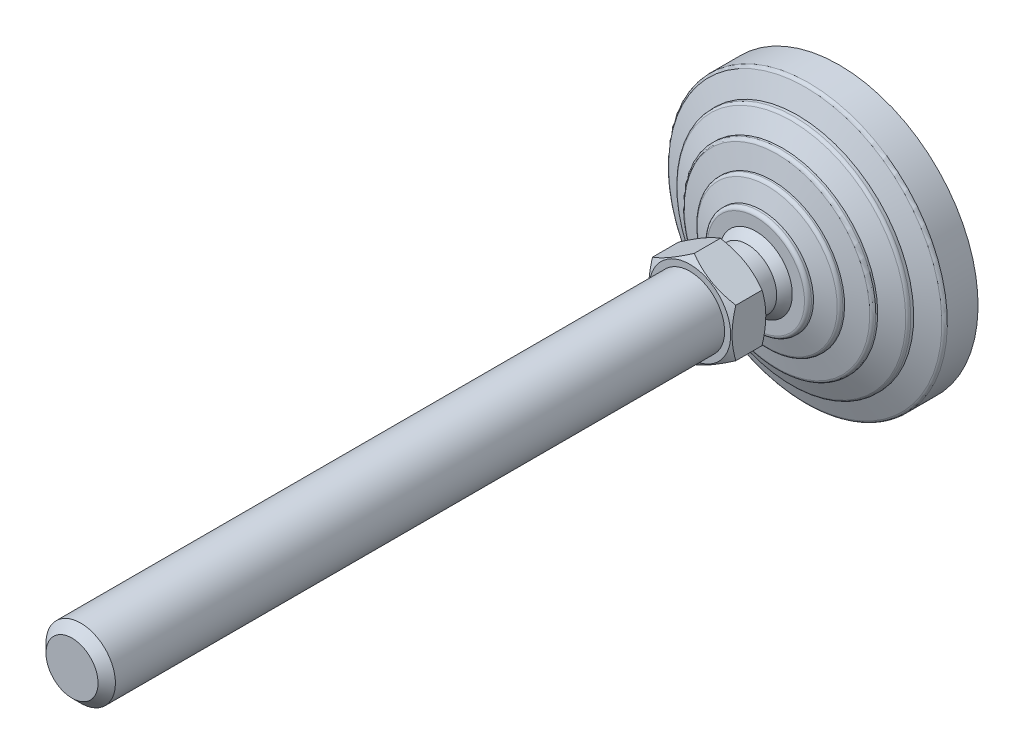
ISO-10303-21;
HEADER;
FILE_DESCRIPTION(('STEP AP214'),'2;1');
FILE_NAME('part.step','',(''),(''),'','','');
FILE_SCHEMA(('AUTOMOTIVE_DESIGN { 1 0 10303 214 1 1 1 1 }'));
ENDSEC;
DATA;
#1=APPLICATION_CONTEXT('core data for automotive mechanical design processes');
#2=APPLICATION_PROTOCOL_DEFINITION('international standard','automotive_design',2000,#1);
#3=PRODUCT_CONTEXT('',#1,'mechanical');
#4=PRODUCT('Part','Part','',(#3));
#5=PRODUCT_RELATED_PRODUCT_CATEGORY('part','',(#4));
#6=PRODUCT_DEFINITION_FORMATION('','',#4);
#7=PRODUCT_DEFINITION_CONTEXT('part definition',#1,'design');
#8=PRODUCT_DEFINITION('design','',#6,#7);
#9=PRODUCT_DEFINITION_SHAPE('','',#8);
#10=(LENGTH_UNIT() NAMED_UNIT(*) SI_UNIT(.MILLI.,.METRE.));
#11=(NAMED_UNIT(*) PLANE_ANGLE_UNIT() SI_UNIT($,.RADIAN.));
#12=(NAMED_UNIT(*) SI_UNIT($,.STERADIAN.) SOLID_ANGLE_UNIT());
#13=UNCERTAINTY_MEASURE_WITH_UNIT(LENGTH_MEASURE(1.E-05),#10,'distance_accuracy_value','');
#14=(GEOMETRIC_REPRESENTATION_CONTEXT(3) GLOBAL_UNCERTAINTY_ASSIGNED_CONTEXT((#13)) GLOBAL_UNIT_ASSIGNED_CONTEXT((#10,
#11,#12)) REPRESENTATION_CONTEXT('',''));
#15=CARTESIAN_POINT('',(0.,0.,0.));
#16=DIRECTION('',(0.,0.,1.));
#17=DIRECTION('',(1.,0.,0.));
#18=AXIS2_PLACEMENT_3D('',#15,#16,#17);
#19=CARTESIAN_POINT('',(-8.5,0.,35.9999999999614));
#20=DIRECTION('',(0.,0.,1.));
#21=DIRECTION('',(0.,-1.,0.));
#22=AXIS2_PLACEMENT_3D('',#19,#20,#21);
#23=PLANE('',#22);
#24=CARTESIAN_POINT('',(0.,0.,35.9999999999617));
#25=DIRECTION('',(0.,0.,-1.));
#26=DIRECTION('',(-1.,0.,0.));
#27=AXIS2_PLACEMENT_3D('',#24,#25,#26);
#28=CIRCLE('',#27,11.75);
#29=CARTESIAN_POINT('',(-11.75,0.,35.9999999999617));
#30=VERTEX_POINT('',#29);
#31=EDGE_CURVE('E596',#30,#30,#28,.T.);
#32=ORIENTED_EDGE('',*,*,#31,.T.);
#33=EDGE_LOOP('',(#32));
#34=FACE_BOUND('',#33,.T.);
#35=CARTESIAN_POINT('',(0.,0.,35.9999999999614));
#36=DIRECTION('',(0.,0.,-1.));
#37=DIRECTION('',(0.,1.,0.));
#38=AXIS2_PLACEMENT_3D('',#35,#36,#37);
#39=CIRCLE('',#38,8.5);
#40=CARTESIAN_POINT('',(0.,8.5,35.9999999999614));
#41=VERTEX_POINT('',#40);
#42=EDGE_CURVE('E156',#41,#41,#39,.T.);
#43=ORIENTED_EDGE('',*,*,#42,.F.);
#44=EDGE_LOOP('',(#43));
#45=FACE_BOUND('',#44,.T.);
#46=ADVANCED_FACE('F14',(#34,#45),#23,.F.);
#47=CARTESIAN_POINT('',(0.,0.,0.));
#48=DIRECTION('',(0.,0.,-1.));
#49=DIRECTION('',(0.,1.,0.));
#50=AXIS2_PLACEMENT_3D('',#47,#48,#49);
#51=CYLINDRICAL_SURFACE('',#50,8.5);
#52=CARTESIAN_POINT('',(0.,0.,29.4999999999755));
#53=DIRECTION('',(0.,0.,-1.));
#54=DIRECTION('',(0.,1.,0.));
#55=AXIS2_PLACEMENT_3D('',#52,#53,#54);
#56=CIRCLE('',#55,8.5);
#57=CARTESIAN_POINT('',(0.,8.5,29.4999999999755));
#58=VERTEX_POINT('',#57);
#59=EDGE_CURVE('E153',#58,#58,#56,.T.);
#60=ORIENTED_EDGE('',*,*,#59,.F.);
#61=EDGE_LOOP('',(#60));
#62=FACE_BOUND('',#61,.T.);
#63=ORIENTED_EDGE('',*,*,#42,.T.);
#64=EDGE_LOOP('',(#63));
#65=FACE_BOUND('',#64,.T.);
#66=ADVANCED_FACE('F180',(#62,#65),#51,.T.);
#67=CARTESIAN_POINT('',(-8.49107182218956,0.,29.4999999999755));
#68=DIRECTION('',(0.,0.,1.));
#69=DIRECTION('',(0.,-1.,0.));
#70=AXIS2_PLACEMENT_3D('',#67,#68,#69);
#71=PLANE('',#70);
#72=CARTESIAN_POINT('',(0.,0.,29.4999999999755));
#73=DIRECTION('',(0.,0.,-1.));
#74=DIRECTION('',(0.,1.,0.));
#75=AXIS2_PLACEMENT_3D('',#72,#73,#74);
#76=CIRCLE('',#75,8.49107182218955);
#77=CARTESIAN_POINT('',(-8.49107182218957,0.,29.4999999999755));
#78=VERTEX_POINT('',#77);
#79=EDGE_CURVE('E150',#78,#78,#76,.T.);
#80=ORIENTED_EDGE('',*,*,#79,.F.);
#81=EDGE_LOOP('',(#80));
#82=FACE_BOUND('',#81,.T.);
#83=ORIENTED_EDGE('',*,*,#59,.T.);
#84=EDGE_LOOP('',(#83));
#85=FACE_BOUND('',#84,.T.);
#86=ADVANCED_FACE('F187',(#82,#85),#71,.F.);
#87=CARTESIAN_POINT('',(-2.99760216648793E-12,0.,20.6702661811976));
#88=DIRECTION('',(0.,0.,-1.));
#89=DIRECTION('',(-1.,0.,0.));
#90=AXIS2_PLACEMENT_3D('',#87,#88,#89);
#91=SPHERICAL_SURFACE('',#90,12.25);
#92=CARTESIAN_POINT('',(0.,0.,27.));
#93=DIRECTION('',(0.,0.,-1.));
#94=DIRECTION('',(0.,1.,0.));
#95=AXIS2_PLACEMENT_3D('',#92,#93,#94);
#96=CIRCLE('',#95,10.4879440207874);
#97=CARTESIAN_POINT('',(-10.4879440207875,0.,27.));
#98=VERTEX_POINT('',#97);
#99=EDGE_CURVE('E147',#98,#98,#96,.T.);
#100=CARTESIAN_POINT('',(-10.4879440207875,0.,27.));
#101=CARTESIAN_POINT('',(-10.4706730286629,0.,27.0286168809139));
#102=CARTESIAN_POINT('',(-10.4532849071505,0.,27.0571630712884));
#103=CARTESIAN_POINT('',(-10.4182755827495,0.,27.1141121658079));
#104=CARTESIAN_POINT('',(-10.4006543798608,0.,27.1425150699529));
#105=CARTESIAN_POINT('',(-10.3651800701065,0.,27.1991756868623));
#106=CARTESIAN_POINT('',(-10.3473269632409,0.,27.2274333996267));
#107=CARTESIAN_POINT('',(-10.3113900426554,0.,27.283801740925));
#108=CARTESIAN_POINT('',(-10.2933062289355,0.,27.3119123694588));
#109=CARTESIAN_POINT('',(-10.2569091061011,0.,27.367984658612));
#110=CARTESIAN_POINT('',(-10.2385957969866,0.,27.3959463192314));
#111=CARTESIAN_POINT('',(-10.2017409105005,0.,27.4517187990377));
#112=CARTESIAN_POINT('',(-10.1831993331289,0.,27.4795296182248));
#113=CARTESIAN_POINT('',(-10.1458891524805,0.,27.5349985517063));
#114=CARTESIAN_POINT('',(-10.1271205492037,0.,27.5626566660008));
#115=CARTESIAN_POINT('',(-10.08935757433,0.,27.6178183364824));
#116=CARTESIAN_POINT('',(-10.0703632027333,0.,27.6453218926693));
#117=CARTESIAN_POINT('',(-10.0321499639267,0.,27.7001726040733));
#118=CARTESIAN_POINT('',(-10.0129310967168,0.,27.7275197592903));
#119=CARTESIAN_POINT('',(-9.97427015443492,0.,27.7820558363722));
#120=CARTESIAN_POINT('',(-9.9548280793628,0.,27.8092447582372));
#121=CARTESIAN_POINT('',(-9.91572202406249,0.,27.8634625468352));
#122=CARTESIAN_POINT('',(-9.8960580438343,0.,27.8904914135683));
#123=CARTESIAN_POINT('',(-9.85650949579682,0.,27.9443872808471));
#124=CARTESIAN_POINT('',(-9.83662492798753,0.,27.9712542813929));
#125=CARTESIAN_POINT('',(-9.79663653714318,0.,28.0248246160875));
#126=CARTESIAN_POINT('',(-9.77653271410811,0.,28.0515279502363));
#127=CARTESIAN_POINT('',(-9.73610715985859,0.,28.1047691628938));
#128=CARTESIAN_POINT('',(-9.71578542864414,0.,28.1313070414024));
#129=CARTESIAN_POINT('',(-9.67492541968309,0.,28.1842155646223));
#130=CARTESIAN_POINT('',(-9.65438714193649,0.,28.2105862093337));
#131=CARTESIAN_POINT('',(-9.61309541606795,0.,28.2631584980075));
#132=CARTESIAN_POINT('',(-9.59234196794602,0.,28.2893601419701));
#133=CARTESIAN_POINT('',(-9.55062129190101,0.,28.3415926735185));
#134=CARTESIAN_POINT('',(-9.52965406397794,0.,28.3676235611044));
#135=CARTESIAN_POINT('',(-9.48750723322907,0.,28.4195128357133));
#136=CARTESIAN_POINT('',(-9.46632763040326,0.,28.4453712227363));
#137=CARTESIAN_POINT('',(-9.42375746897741,0.,28.4969137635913));
#138=CARTESIAN_POINT('',(-9.40236691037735,0.,28.5225979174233));
#139=CARTESIAN_POINT('',(-9.35937627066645,0.,28.5737902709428));
#140=CARTESIAN_POINT('',(-9.3377761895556,0.,28.5992984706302));
#141=CARTESIAN_POINT('',(-9.29436795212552,0.,28.6501372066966));
#142=CARTESIAN_POINT('',(-9.27255979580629,0.,28.6754677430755));
#143=CARTESIAN_POINT('',(-9.22873686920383,0.,28.7259494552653));
#144=CARTESIAN_POINT('',(-9.2067220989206,0.,28.7511006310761));
#145=CARTESIAN_POINT('',(-9.16248741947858,0.,28.8012219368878));
#146=CARTESIAN_POINT('',(-9.14026751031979,0.,28.8261920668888));
#147=CARTESIAN_POINT('',(-9.09562404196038,0.,28.87594960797));
#148=CARTESIAN_POINT('',(-9.07320048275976,0.,28.9007370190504));
#149=CARTESIAN_POINT('',(-9.02815121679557,0.,28.9501274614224));
#150=CARTESIAN_POINT('',(-9.005525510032,0.,28.974730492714));
#151=CARTESIAN_POINT('',(-8.96007346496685,0.,29.023750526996));
#152=CARTESIAN_POINT('',(-8.93724712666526,0.,29.0481675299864));
#153=CARTESIAN_POINT('',(-8.89139534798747,0.,29.0968138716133));
#154=CARTESIAN_POINT('',(-8.86836990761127,0.,29.1210432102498));
#155=CARTESIAN_POINT('',(-8.82212146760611,0.,29.1693125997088));
#156=CARTESIAN_POINT('',(-8.79889846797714,0.,29.1933526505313));
#157=CARTESIAN_POINT('',(-8.75225646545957,0.,29.2412418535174));
#158=CARTESIAN_POINT('',(-8.72883746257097,0.,29.2650910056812));
#159=CARTESIAN_POINT('',(-8.6818050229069,0.,29.3125968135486));
#160=CARTESIAN_POINT('',(-8.65819158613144,0.,29.3362534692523));
#161=CARTESIAN_POINT('',(-8.61077186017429,0.,29.3833726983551));
#162=CARTESIAN_POINT('',(-8.58696557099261,0.,29.4068352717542));
#163=CARTESIAN_POINT('',(-8.53916173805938,0.,29.4535647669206));
#164=CARTESIAN_POINT('',(-8.51516419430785,0.,29.4768316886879));
#165=CARTESIAN_POINT('',(-8.49107182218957,0.,29.4999999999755));
#166=B_SPLINE_CURVE_WITH_KNOTS('',3,(#100,#101,#102,#103,#104,#105,#106,#107,#108,#109,#110,
#111,#112,#113,#114,#115,#116,#117,#118,#119,#120,#121,#122,#123,#124,#125,#126,#127,#128,#129,
#130,#131,#132,#133,#134,#135,#136,#137,#138,#139,#140,#141,#142,#143,#144,#145,#146,#147,#148,
#149,#150,#151,#152,#153,#154,#155,#156,#157,#158,#159,#160,#161,#162,#163,#164,#165),
.UNSPECIFIED.,.F.,.F.,(4,2,2,2,2,2,2,2,2,2,2,2,2,2,2,2,2,2,2,2,2,2,2,2,2,2,2,2,2,2,2,2,4),(0.,
0.100273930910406,0.200547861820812,0.300821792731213,0.401095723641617,0.501369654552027,
0.60164358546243,0.701917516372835,0.802191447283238,0.902465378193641,1.00273930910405,
1.10301324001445,1.20328717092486,1.30356110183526,1.40383503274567,1.50410896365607,
1.60438289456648,1.70465682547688,1.80493075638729,1.90520468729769,2.00547861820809,
2.1057525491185,2.20602648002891,2.30630041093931,2.40657434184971,2.50684827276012,
2.60712220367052,2.70739613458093,2.80767006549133,2.90794399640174,3.00821792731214,
3.10849185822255,3.20876578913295),.UNSPECIFIED.);
#167=EDGE_CURVE('BSEAM459',#98,#78,#166,.T.);
#168=ORIENTED_EDGE('',*,*,#99,.F.);
#169=ORIENTED_EDGE('',*,*,#79,.T.);
#170=ORIENTED_EDGE('',*,*,#167,.T.);
#171=ORIENTED_EDGE('',*,*,#167,.F.);
#172=EDGE_LOOP('',(#168,#170,#169,#171));
#173=FACE_BOUND('',#172,.T.);
#174=ADVANCED_FACE('F459',(#173),#91,.T.);
#175=CARTESIAN_POINT('',(-10.4879440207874,0.,27.));
#176=DIRECTION('',(0.,0.,-1.));
#177=DIRECTION('',(0.,1.,0.));
#178=AXIS2_PLACEMENT_3D('',#175,#176,#177);
#179=PLANE('',#178);
#180=CARTESIAN_POINT('',(0.,0.,27.));
#181=DIRECTION('',(0.,0.,-1.));
#182=DIRECTION('',(0.,1.,0.));
#183=AXIS2_PLACEMENT_3D('',#180,#181,#182);
#184=CIRCLE('',#183,14.);
#185=CARTESIAN_POINT('',(0.,14.,27.));
#186=VERTEX_POINT('',#185);
#187=EDGE_CURVE('E144',#186,#186,#184,.T.);
#188=ORIENTED_EDGE('',*,*,#187,.F.);
#189=EDGE_LOOP('',(#188));
#190=FACE_BOUND('',#189,.T.);
#191=ORIENTED_EDGE('',*,*,#99,.T.);
#192=EDGE_LOOP('',(#191));
#193=FACE_BOUND('',#192,.T.);
#194=ADVANCED_FACE('F449',(#190,#193),#179,.F.);
#195=CARTESIAN_POINT('',(0.,0.,26.));
#196=DIRECTION('',(0.,0.,-1.));
#197=DIRECTION('',(0.,1.,0.));
#198=AXIS2_PLACEMENT_3D('',#195,#196,#197);
#199=TOROIDAL_SURFACE('',#198,14.,1.);
#200=CARTESIAN_POINT('',(0.,0.,26.));
#201=DIRECTION('',(0.,0.,-1.));
#202=DIRECTION('',(0.,1.,0.));
#203=AXIS2_PLACEMENT_3D('',#200,#201,#202);
#204=CIRCLE('',#203,15.);
#205=CARTESIAN_POINT('',(0.,15.,26.));
#206=VERTEX_POINT('',#205);
#207=EDGE_CURVE('E141',#206,#206,#204,.T.);
#208=ORIENTED_EDGE('',*,*,#207,.F.);
#209=EDGE_LOOP('',(#208));
#210=FACE_BOUND('',#209,.T.);
#211=ORIENTED_EDGE('',*,*,#187,.T.);
#212=EDGE_LOOP('',(#211));
#213=FACE_BOUND('',#212,.T.);
#214=ADVANCED_FACE('F439',(#210,#213),#199,.T.);
#215=CARTESIAN_POINT('',(0.,0.,0.));
#216=DIRECTION('',(0.,0.,-1.));
#217=DIRECTION('',(0.,1.,0.));
#218=AXIS2_PLACEMENT_3D('',#215,#216,#217);
#219=CYLINDRICAL_SURFACE('',#218,15.);
#220=CARTESIAN_POINT('',(0.,0.,25.4025287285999));
#221=DIRECTION('',(0.,0.,-1.));
#222=DIRECTION('',(0.,1.,0.));
#223=AXIS2_PLACEMENT_3D('',#220,#221,#222);
#224=CIRCLE('',#223,15.);
#225=CARTESIAN_POINT('',(0.,15.,25.4025287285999));
#226=VERTEX_POINT('',#225);
#227=EDGE_CURVE('E138',#226,#226,#224,.T.);
#228=ORIENTED_EDGE('',*,*,#227,.F.);
#229=EDGE_LOOP('',(#228));
#230=FACE_BOUND('',#229,.T.);
#231=ORIENTED_EDGE('',*,*,#207,.T.);
#232=EDGE_LOOP('',(#231));
#233=FACE_BOUND('',#232,.T.);
#234=ADVANCED_FACE('F429',(#230,#233),#219,.T.);
#235=CARTESIAN_POINT('',(0.,0.,25.4025287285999));
#236=DIRECTION('',(0.,0.,-1.));
#237=DIRECTION('',(0.,1.,0.));
#238=AXIS2_PLACEMENT_3D('',#235,#236,#237);
#239=CONICAL_SURFACE('',#238,15.,1.25589726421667);
#240=CARTESIAN_POINT('',(0.,0.,23.7216684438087));
#241=DIRECTION('',(0.,0.,-1.));
#242=DIRECTION('',(0.,1.,0.));
#243=AXIS2_PLACEMENT_3D('',#240,#241,#242);
#244=CIRCLE('',#243,20.1601635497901);
#245=CARTESIAN_POINT('',(0.,20.1601635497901,23.7216684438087));
#246=VERTEX_POINT('',#245);
#247=EDGE_CURVE('E135',#246,#246,#244,.T.);
#248=ORIENTED_EDGE('',*,*,#247,.F.);
#249=EDGE_LOOP('',(#248));
#250=FACE_BOUND('',#249,.T.);
#251=ORIENTED_EDGE('',*,*,#227,.T.);
#252=EDGE_LOOP('',(#251));
#253=FACE_BOUND('',#252,.T.);
#254=ADVANCED_FACE('F419',(#250,#253),#239,.T.);
#255=CARTESIAN_POINT('',(0.,0.,22.7708407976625));
#256=DIRECTION('',(0.,0.,-1.));
#257=DIRECTION('',(0.,1.,0.));
#258=AXIS2_PLACEMENT_3D('',#255,#256,#257);
#259=TOROIDAL_SURFACE('',#258,19.8504430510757,1.);
#260=CARTESIAN_POINT('',(0.,0.,22.7708407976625));
#261=DIRECTION('',(0.,0.,-1.));
#262=DIRECTION('',(0.,1.,0.));
#263=AXIS2_PLACEMENT_3D('',#260,#261,#262);
#264=CIRCLE('',#263,20.8504430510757);
#265=CARTESIAN_POINT('',(0.,20.8504430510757,22.7708407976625));
#266=VERTEX_POINT('',#265);
#267=EDGE_CURVE('E132',#266,#266,#264,.T.);
#268=ORIENTED_EDGE('',*,*,#267,.F.);
#269=EDGE_LOOP('',(#268));
#270=FACE_BOUND('',#269,.T.);
#271=ORIENTED_EDGE('',*,*,#247,.T.);
#272=EDGE_LOOP('',(#271));
#273=FACE_BOUND('',#272,.T.);
#274=ADVANCED_FACE('F409',(#270,#273),#259,.T.);
#275=CARTESIAN_POINT('',(0.,0.,0.));
#276=DIRECTION('',(0.,0.,-1.));
#277=DIRECTION('',(0.,1.,0.));
#278=AXIS2_PLACEMENT_3D('',#275,#276,#277);
#279=CYLINDRICAL_SURFACE('',#278,20.8504430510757);
#280=CARTESIAN_POINT('',(0.,0.,22.2987385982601));
#281=DIRECTION('',(0.,0.,-1.));
#282=DIRECTION('',(0.,1.,0.));
#283=AXIS2_PLACEMENT_3D('',#280,#281,#282);
#284=CIRCLE('',#283,20.8504430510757);
#285=CARTESIAN_POINT('',(0.,20.8504430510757,22.2987385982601));
#286=VERTEX_POINT('',#285);
#287=EDGE_CURVE('E129',#286,#286,#284,.T.);
#288=ORIENTED_EDGE('',*,*,#287,.F.);
#289=EDGE_LOOP('',(#288));
#290=FACE_BOUND('',#289,.T.);
#291=ORIENTED_EDGE('',*,*,#267,.T.);
#292=EDGE_LOOP('',(#291));
#293=FACE_BOUND('',#292,.T.);
#294=ADVANCED_FACE('F399',(#290,#293),#279,.T.);
#295=CARTESIAN_POINT('',(0.,0.,22.2987385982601));
#296=DIRECTION('',(0.,0.,-1.));
#297=DIRECTION('',(0.,1.,0.));
#298=AXIS2_PLACEMENT_3D('',#295,#296,#297);
#299=CONICAL_SURFACE('',#298,20.8504430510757,1.34067144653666);
#300=CARTESIAN_POINT('',(0.,0.,20.9217501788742));
#301=DIRECTION('',(0.,0.,-1.));
#302=DIRECTION('',(0.,1.,0.));
#303=AXIS2_PLACEMENT_3D('',#300,#301,#302);
#304=CIRCLE('',#303,26.7280991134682);
#305=CARTESIAN_POINT('',(0.,26.7280991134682,20.9217501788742));
#306=VERTEX_POINT('',#305);
#307=EDGE_CURVE('E126',#306,#306,#304,.T.);
#308=ORIENTED_EDGE('',*,*,#307,.F.);
#309=EDGE_LOOP('',(#308));
#310=FACE_BOUND('',#309,.T.);
#311=ORIENTED_EDGE('',*,*,#287,.T.);
#312=EDGE_LOOP('',(#311));
#313=FACE_BOUND('',#312,.T.);
#314=ADVANCED_FACE('F389',(#310,#313),#299,.T.);
#315=CARTESIAN_POINT('',(0.,0.,19.9481122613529));
#316=DIRECTION('',(0.,0.,-1.));
#317=DIRECTION('',(0.,1.,0.));
#318=AXIS2_PLACEMENT_3D('',#315,#316,#317);
#319=TOROIDAL_SURFACE('',#318,26.5,1.);
#320=CARTESIAN_POINT('',(0.,0.,19.9481122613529));
#321=DIRECTION('',(0.,0.,-1.));
#322=DIRECTION('',(0.,1.,0.));
#323=AXIS2_PLACEMENT_3D('',#320,#321,#322);
#324=CIRCLE('',#323,27.5);
#325=CARTESIAN_POINT('',(0.,27.5,19.9481122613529));
#326=VERTEX_POINT('',#325);
#327=EDGE_CURVE('E123',#326,#326,#324,.T.);
#328=ORIENTED_EDGE('',*,*,#327,.F.);
#329=EDGE_LOOP('',(#328));
#330=FACE_BOUND('',#329,.T.);
#331=ORIENTED_EDGE('',*,*,#307,.T.);
#332=EDGE_LOOP('',(#331));
#333=FACE_BOUND('',#332,.T.);
#334=ADVANCED_FACE('F379',(#330,#333),#319,.T.);
#335=CARTESIAN_POINT('',(0.,0.,0.));
#336=DIRECTION('',(0.,0.,-1.));
#337=DIRECTION('',(0.,1.,0.));
#338=AXIS2_PLACEMENT_3D('',#335,#336,#337);
#339=CYLINDRICAL_SURFACE('',#338,27.5);
#340=CARTESIAN_POINT('',(0.,0.,19.4025287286));
#341=DIRECTION('',(0.,0.,-1.));
#342=DIRECTION('',(0.,1.,0.));
#343=AXIS2_PLACEMENT_3D('',#340,#341,#342);
#344=CIRCLE('',#343,27.5);
#345=CARTESIAN_POINT('',(0.,27.5,19.4025287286));
#346=VERTEX_POINT('',#345);
#347=EDGE_CURVE('E120',#346,#346,#344,.T.);
#348=ORIENTED_EDGE('',*,*,#347,.F.);
#349=EDGE_LOOP('',(#348));
#350=FACE_BOUND('',#349,.T.);
#351=ORIENTED_EDGE('',*,*,#327,.T.);
#352=EDGE_LOOP('',(#351));
#353=FACE_BOUND('',#352,.T.);
#354=ADVANCED_FACE('F369',(#350,#353),#339,.T.);
#355=CARTESIAN_POINT('',(0.,0.,19.4025287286));
#356=DIRECTION('',(0.,0.,-1.));
#357=DIRECTION('',(0.,1.,0.));
#358=AXIS2_PLACEMENT_3D('',#355,#356,#357);
#359=CONICAL_SURFACE('',#358,27.5,1.12022914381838);
#360=CARTESIAN_POINT('',(0.,0.,16.7730910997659));
#361=DIRECTION('',(0.,0.,-1.));
#362=DIRECTION('',(0.,1.,0.));
#363=AXIS2_PLACEMENT_3D('',#360,#361,#362);
#364=CIRCLE('',#363,32.9354761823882);
#365=CARTESIAN_POINT('',(0.,32.9354761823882,16.7730910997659));
#366=VERTEX_POINT('',#365);
#367=EDGE_CURVE('E117',#366,#366,#364,.T.);
#368=ORIENTED_EDGE('',*,*,#367,.F.);
#369=EDGE_LOOP('',(#368));
#370=FACE_BOUND('',#369,.T.);
#371=ORIENTED_EDGE('',*,*,#347,.T.);
#372=EDGE_LOOP('',(#371));
#373=FACE_BOUND('',#372,.T.);
#374=ADVANCED_FACE('F359',(#370,#373),#359,.T.);
#375=CARTESIAN_POINT('',(0.,0.,15.8728908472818));
#376=DIRECTION('',(0.,0.,-1.));
#377=DIRECTION('',(0.,1.,0.));
#378=AXIS2_PLACEMENT_3D('',#375,#376,#377);
#379=TOROIDAL_SURFACE('',#378,32.5,1.);
#380=CARTESIAN_POINT('',(0.,0.,15.8728908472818));
#381=DIRECTION('',(0.,0.,-1.));
#382=DIRECTION('',(0.,1.,0.));
#383=AXIS2_PLACEMENT_3D('',#380,#381,#382);
#384=CIRCLE('',#383,33.5);
#385=CARTESIAN_POINT('',(0.,33.5,15.8728908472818));
#386=VERTEX_POINT('',#385);
#387=EDGE_CURVE('E114',#386,#386,#384,.T.);
#388=ORIENTED_EDGE('',*,*,#387,.F.);
#389=EDGE_LOOP('',(#388));
#390=FACE_BOUND('',#389,.T.);
#391=ORIENTED_EDGE('',*,*,#367,.T.);
#392=EDGE_LOOP('',(#391));
#393=FACE_BOUND('',#392,.T.);
#394=ADVANCED_FACE('F349',(#390,#393),#379,.T.);
#395=CARTESIAN_POINT('',(0.,0.,0.));
#396=DIRECTION('',(0.,0.,-1.));
#397=DIRECTION('',(0.,1.,0.));
#398=AXIS2_PLACEMENT_3D('',#395,#396,#397);
#399=CYLINDRICAL_SURFACE('',#398,33.5);
#400=CARTESIAN_POINT('',(0.,0.,15.0315037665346));
#401=DIRECTION('',(0.,0.,-1.));
#402=DIRECTION('',(0.,1.,0.));
#403=AXIS2_PLACEMENT_3D('',#400,#401,#402);
#404=CIRCLE('',#403,33.5);
#405=CARTESIAN_POINT('',(0.,33.5,15.0315037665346));
#406=VERTEX_POINT('',#405);
#407=EDGE_CURVE('E111',#406,#406,#404,.T.);
#408=ORIENTED_EDGE('',*,*,#407,.F.);
#409=EDGE_LOOP('',(#408));
#410=FACE_BOUND('',#409,.T.);
#411=ORIENTED_EDGE('',*,*,#387,.T.);
#412=EDGE_LOOP('',(#411));
#413=FACE_BOUND('',#412,.T.);
#414=ADVANCED_FACE('F339',(#410,#413),#399,.T.);
#415=CARTESIAN_POINT('',(0.,0.,15.0315037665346));
#416=DIRECTION('',(0.,0.,-1.));
#417=DIRECTION('',(0.,1.,0.));
#418=AXIS2_PLACEMENT_3D('',#415,#416,#417);
#419=CONICAL_SURFACE('',#418,33.5,1.20362249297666);
#420=CARTESIAN_POINT('',(0.,0.,12.7780502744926));
#421=DIRECTION('',(0.,0.,-1.));
#422=DIRECTION('',(0.,1.,0.));
#423=AXIS2_PLACEMENT_3D('',#420,#421,#422);
#424=CIRCLE('',#423,39.3589790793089);
#425=CARTESIAN_POINT('',(0.,39.3589790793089,12.7780502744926));
#426=VERTEX_POINT('',#425);
#427=EDGE_CURVE('E108',#426,#426,#424,.T.);
#428=ORIENTED_EDGE('',*,*,#427,.F.);
#429=EDGE_LOOP('',(#428));
#430=FACE_BOUND('',#429,.T.);
#431=ORIENTED_EDGE('',*,*,#407,.T.);
#432=EDGE_LOOP('',(#431));
#433=FACE_BOUND('',#432,.T.);
#434=ADVANCED_FACE('F329',(#430,#433),#419,.T.);
#435=CARTESIAN_POINT('',(0.,0.,11.8447046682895));
#436=DIRECTION('',(0.,0.,-1.));
#437=DIRECTION('',(0.,1.,0.));
#438=AXIS2_PLACEMENT_3D('',#435,#436,#437);
#439=TOROIDAL_SURFACE('',#438,39.,1.);
#440=CARTESIAN_POINT('',(0.,0.,11.8447046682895));
#441=DIRECTION('',(0.,0.,-1.));
#442=DIRECTION('',(0.,1.,0.));
#443=AXIS2_PLACEMENT_3D('',#440,#441,#442);
#444=CIRCLE('',#443,40.);
#445=CARTESIAN_POINT('',(0.,40.,11.8447046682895));
#446=VERTEX_POINT('',#445);
#447=EDGE_CURVE('E105',#446,#446,#444,.T.);
#448=ORIENTED_EDGE('',*,*,#447,.F.);
#449=EDGE_LOOP('',(#448));
#450=FACE_BOUND('',#449,.T.);
#451=ORIENTED_EDGE('',*,*,#427,.T.);
#452=EDGE_LOOP('',(#451));
#453=FACE_BOUND('',#452,.T.);
#454=ADVANCED_FACE('F319',(#450,#453),#439,.T.);
#455=CARTESIAN_POINT('',(0.,0.,0.));
#456=DIRECTION('',(0.,0.,-1.));
#457=DIRECTION('',(0.,1.,0.));
#458=AXIS2_PLACEMENT_3D('',#455,#456,#457);
#459=CYLINDRICAL_SURFACE('',#458,40.);
#460=CARTESIAN_POINT('',(0.,0.,3.));
#461=DIRECTION('',(0.,0.,-1.));
#462=DIRECTION('',(0.,1.,0.));
#463=AXIS2_PLACEMENT_3D('',#460,#461,#462);
#464=CIRCLE('',#463,40.);
#465=CARTESIAN_POINT('',(0.,40.,3.));
#466=VERTEX_POINT('',#465);
#467=EDGE_CURVE('E102',#466,#466,#464,.T.);
#468=ORIENTED_EDGE('',*,*,#467,.F.);
#469=EDGE_LOOP('',(#468));
#470=FACE_BOUND('',#469,.T.);
#471=ORIENTED_EDGE('',*,*,#447,.T.);
#472=EDGE_LOOP('',(#471));
#473=FACE_BOUND('',#472,.T.);
#474=ADVANCED_FACE('F309',(#470,#473),#459,.T.);
#475=CARTESIAN_POINT('',(-33.5,0.,3.));
#476=DIRECTION('',(0.,0.,1.));
#477=DIRECTION('',(0.,-1.,0.));
#478=AXIS2_PLACEMENT_3D('',#475,#476,#477);
#479=PLANE('',#478);
#480=CARTESIAN_POINT('',(0.,0.,3.));
#481=DIRECTION('',(0.,0.,-1.));
#482=DIRECTION('',(0.,1.,0.));
#483=AXIS2_PLACEMENT_3D('',#480,#481,#482);
#484=CIRCLE('',#483,33.5);
#485=CARTESIAN_POINT('',(0.,33.5,3.));
#486=VERTEX_POINT('',#485);
#487=EDGE_CURVE('E99',#486,#486,#484,.T.);
#488=ORIENTED_EDGE('',*,*,#487,.F.);
#489=EDGE_LOOP('',(#488));
#490=FACE_BOUND('',#489,.T.);
#491=ORIENTED_EDGE('',*,*,#467,.T.);
#492=EDGE_LOOP('',(#491));
#493=FACE_BOUND('',#492,.T.);
#494=ADVANCED_FACE('F299',(#490,#493),#479,.F.);
#495=CARTESIAN_POINT('',(0.,0.,0.));
#496=DIRECTION('',(0.,0.,-1.));
#497=DIRECTION('',(0.,1.,0.));
#498=AXIS2_PLACEMENT_3D('',#495,#496,#497);
#499=CYLINDRICAL_SURFACE('',#498,33.5);
#500=CARTESIAN_POINT('',(0.,0.,0.));
#501=DIRECTION('',(0.,0.,-1.));
#502=DIRECTION('',(0.,1.,0.));
#503=AXIS2_PLACEMENT_3D('',#500,#501,#502);
#504=CIRCLE('',#503,33.5);
#505=CARTESIAN_POINT('',(0.,33.5,0.));
#506=VERTEX_POINT('',#505);
#507=EDGE_CURVE('E96',#506,#506,#504,.T.);
#508=ORIENTED_EDGE('',*,*,#507,.F.);
#509=EDGE_LOOP('',(#508));
#510=FACE_BOUND('',#509,.T.);
#511=ORIENTED_EDGE('',*,*,#487,.T.);
#512=EDGE_LOOP('',(#511));
#513=FACE_BOUND('',#512,.T.);
#514=ADVANCED_FACE('F288',(#510,#513),#499,.T.);
#515=CARTESIAN_POINT('',(0.,0.,0.));
#516=DIRECTION('',(0.,0.,1.));
#517=DIRECTION('',(0.,-1.,0.));
#518=AXIS2_PLACEMENT_3D('',#515,#516,#517);
#519=PLANE('',#518);
#520=ORIENTED_EDGE('',*,*,#507,.T.);
#521=EDGE_LOOP('',(#520));
#522=FACE_BOUND('',#521,.T.);
#523=ADVANCED_FACE('F178',(#522),#519,.F.);
#524=CARTESIAN_POINT('',(0.,0.,38.685210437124));
#525=DIRECTION('',(0.,0.,1.));
#526=DIRECTION('',(1.,0.,0.));
#527=AXIS2_PLACEMENT_3D('',#524,#525,#526);
#528=CONICAL_SURFACE('',#527,16.4009209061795,1.0471975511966);
#529=CARTESIAN_POINT('',(0.436482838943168,-14.1084099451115,37.365525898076));
#530=CARTESIAN_POINT('',(0.156380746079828,-13.9466929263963,37.267226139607));
#531=CARTESIAN_POINT('',(-0.124814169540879,-13.7843449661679,37.1731374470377));
#532=CARTESIAN_POINT('',(-0.689649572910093,-13.4582370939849,36.9946709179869));
#533=CARTESIAN_POINT('',(-0.973291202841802,-13.2944765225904,36.9102979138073));
#534=CARTESIAN_POINT('',(-1.82945104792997,-12.8001724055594,36.6733876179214));
#535=CARTESIAN_POINT('',(-2.40563890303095,-12.4675101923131,36.5376239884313));
#536=CARTESIAN_POINT('',(-3.26733279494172,-11.9700109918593,36.3775779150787));
#537=CARTESIAN_POINT('',(-3.54992406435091,-11.8068568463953,36.3318715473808));
#538=CARTESIAN_POINT('',(-4.11659667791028,-11.4796882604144,36.2547689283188));
#539=CARTESIAN_POINT('',(-4.4006780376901,-11.3156738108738,36.2233728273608));
#540=CARTESIAN_POINT('',(-4.96933794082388,-10.9873578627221,36.1757902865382));
#541=CARTESIAN_POINT('',(-5.25391494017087,-10.823057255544,36.1595793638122));
#542=CARTESIAN_POINT('',(-5.823417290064,-10.4942549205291,36.142742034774));
#543=CARTESIAN_POINT('',(-6.10834264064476,-10.3297531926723,36.1421156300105));
#544=CARTESIAN_POINT('',(-6.69582414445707,-9.99057058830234,36.1569217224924));
#545=CARTESIAN_POINT('',(-6.99836131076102,-9.81590067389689,36.1733674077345));
#546=CARTESIAN_POINT('',(-7.60237150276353,-9.46717522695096,36.2233610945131));
#547=CARTESIAN_POINT('',(-7.90384449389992,-9.29311971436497,36.2569096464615));
#548=CARTESIAN_POINT('',(-8.50568618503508,-8.94564625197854,36.3401661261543));
#549=CARTESIAN_POINT('',(-8.80605164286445,-8.77223017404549,36.3899050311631));
#550=CARTESIAN_POINT('',(-9.40464571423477,-8.42663172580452,36.5041563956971));
#551=CARTESIAN_POINT('',(-9.70287435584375,-8.25444933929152,36.5686686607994));
#552=CARTESIAN_POINT('',(-10.3064394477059,-7.90598087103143,36.7132019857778));
#553=CARTESIAN_POINT('',(-10.6116981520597,-7.72973967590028,36.793653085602));
#554=CARTESIAN_POINT('',(-11.2195861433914,-7.37877538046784,36.9669357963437));
#555=CARTESIAN_POINT('',(-11.5222151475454,-7.20405244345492,37.059768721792));
#556=CARTESIAN_POINT('',(-12.1235856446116,-6.85685102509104,37.2557500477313));
#557=CARTESIAN_POINT('',(-12.4223380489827,-6.68436624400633,37.358854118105));
#558=CARTESIAN_POINT('',(-13.0172392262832,-6.34089988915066,37.5742190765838));
#559=CARTESIAN_POINT('',(-13.3133889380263,-6.16991777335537,37.6864764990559));
#560=CARTESIAN_POINT('',(-13.6083566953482,-5.99961805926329,37.8026118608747));
#561=B_SPLINE_CURVE_WITH_KNOTS('',3,(#529,#530,#531,#532,#533,#534,#535,#536,#537,#538,#539,
#540,#541,#542,#543,#544,#545,#546,#547,#548,#549,#550,#551,#552,#553,#554,#555,#556,#557,#558,
#559,#560),.UNSPECIFIED.,.F.,.F.,(4,2,2,2,2,2,2,2,2,2,2,2,2,2,2,4),(0.,1.01404161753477,
2.02858543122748,4.06334493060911,5.05157269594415,6.03981084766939,7.02645291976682,
8.01309508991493,9.06183402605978,10.1106067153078,11.1613979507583,12.2121753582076,
13.2965609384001,14.3810617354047,15.4610694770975,16.5406701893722),.UNSPECIFIED.);
#562=CARTESIAN_POINT('',(0.,-13.856406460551,37.2161343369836));
#563=VERTEX_POINT('',#562);
#564=CARTESIAN_POINT('',(-12.,-6.92820323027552,37.2161343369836));
#565=VERTEX_POINT('',#564);
#566=EDGE_CURVE('E73',#563,#565,#561,.T.);
#567=ORIENTED_EDGE('',*,*,#566,.T.);
#568=CARTESIAN_POINT('',(-12.,-18.5589971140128,41.9759197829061));
#569=CARTESIAN_POINT('',(-12.,-18.29716133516,41.8489763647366));
#570=CARTESIAN_POINT('',(-12.,-18.0350169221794,41.7226698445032));
#571=CARTESIAN_POINT('',(-12.,-17.5100464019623,41.4714749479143));
#572=CARTESIAN_POINT('',(-12.,-17.2472202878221,41.3465865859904));
#573=CARTESIAN_POINT('',(-12.,-16.4575520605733,40.9742320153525));
#574=CARTESIAN_POINT('',(-12.,-15.9295983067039,40.7291143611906));
#575=CARTESIAN_POINT('',(-12.,-14.8672429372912,40.2453031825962));
#576=CARTESIAN_POINT('',(-12.,-14.332821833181,40.0066523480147));
#577=CARTESIAN_POINT('',(-12.,-13.2597117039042,39.5391815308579));
#578=CARTESIAN_POINT('',(-12.,-12.721022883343,39.3103610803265));
#579=CARTESIAN_POINT('',(-12.,-11.6213243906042,38.8580818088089));
#580=CARTESIAN_POINT('',(-12.,-11.0601490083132,38.6350237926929));
#581=CARTESIAN_POINT('',(-12.,-9.93121002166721,38.2059127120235));
#582=CARTESIAN_POINT('',(-12.,-9.36344568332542,37.9998615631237));
#583=CARTESIAN_POINT('',(-12.,-8.2215234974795,37.6102139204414));
#584=CARTESIAN_POINT('',(-12.,-7.64738144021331,37.4265715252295));
#585=CARTESIAN_POINT('',(-12.,-6.49080719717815,37.087657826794));
#586=CARTESIAN_POINT('',(-12.,-5.90837770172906,36.9323775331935));
#587=CARTESIAN_POINT('',(-12.,-5.03002970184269,36.7267966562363));
#588=CARTESIAN_POINT('',(-12.,-4.73725930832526,36.662962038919));
#589=CARTESIAN_POINT('',(-12.,-4.14972766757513,36.5451713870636));
#590=CARTESIAN_POINT('',(-12.,-3.85496646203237,36.4912151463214));
#591=CARTESIAN_POINT('',(-12.,-3.26365979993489,36.3941367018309));
#592=CARTESIAN_POINT('',(-12.,-2.9671143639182,36.3510143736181));
#593=CARTESIAN_POINT('',(-12.,-2.37255811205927,36.2764659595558));
#594=CARTESIAN_POINT('',(-12.,-2.0745473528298,36.2450394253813));
#595=CARTESIAN_POINT('',(-12.,-1.4813452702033,36.1948980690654));
#596=CARTESIAN_POINT('',(-12.,-1.1861675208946,36.176023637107));
#597=CARTESIAN_POINT('',(-12.,-0.595279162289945,36.1507709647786));
#598=CARTESIAN_POINT('',(-12.,-0.299568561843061,36.1443925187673));
#599=CARTESIAN_POINT('',(-12.,0.291858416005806,36.1442833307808));
#600=CARTESIAN_POINT('',(-12.,0.58757479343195,36.1505526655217));
#601=CARTESIAN_POINT('',(-12.,1.17848170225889,36.1755870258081));
#602=CARTESIAN_POINT('',(-12.,1.4736722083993,36.1943526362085));
#603=CARTESIAN_POINT('',(-12.,2.18466176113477,36.254204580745));
#604=CARTESIAN_POINT('',(-12.,2.59996321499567,36.3013062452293));
#605=CARTESIAN_POINT('',(-12.,3.42745260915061,36.4176665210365));
#606=CARTESIAN_POINT('',(-12.,3.83964011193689,36.4869281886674));
#607=CARTESIAN_POINT('',(-12.,4.66051950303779,36.6451444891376));
#608=CARTESIAN_POINT('',(-12.,5.06920837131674,36.734114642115));
#609=CARTESIAN_POINT('',(-12.,5.8824711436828,36.92903586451));
#610=CARTESIAN_POINT('',(-12.,6.2870451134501,37.0349866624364));
#611=CARTESIAN_POINT('',(-12.,7.10093766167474,37.2637878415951));
#612=CARTESIAN_POINT('',(-12.,7.51016576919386,37.3869578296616));
#613=CARTESIAN_POINT('',(-12.,8.32459007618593,37.645908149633));
#614=CARTESIAN_POINT('',(-12.,8.72978624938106,37.7816885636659));
#615=CARTESIAN_POINT('',(-12.,9.53634890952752,38.0637139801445));
#616=CARTESIAN_POINT('',(-12.,9.93771664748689,38.2099554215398));
#617=CARTESIAN_POINT('',(-12.,10.7371340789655,38.5111937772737));
#618=CARTESIAN_POINT('',(-12.,11.1351838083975,38.6661905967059));
#619=CARTESIAN_POINT('',(-12.,12.06235413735,39.0370954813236));
#620=CARTESIAN_POINT('',(-12.,12.5903184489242,39.2558893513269));
#621=CARTESIAN_POINT('',(-12.,13.6418557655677,39.7038159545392));
#622=CARTESIAN_POINT('',(-12.,14.1654285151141,39.9329492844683));
#623=CARTESIAN_POINT('',(-12.,15.208984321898,40.3995182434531));
#624=CARTESIAN_POINT('',(-12.,15.7289666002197,40.6369556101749));
#625=CARTESIAN_POINT('',(-12.,16.7658202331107,41.1184858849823));
#626=CARTESIAN_POINT('',(-12.,17.2826916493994,41.3625786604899));
#627=CARTESIAN_POINT('',(-12.,18.3143708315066,41.8564529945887));
#628=CARTESIAN_POINT('',(-12.,18.8291758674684,42.1062402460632));
#629=CARTESIAN_POINT('',(-12.,19.8565867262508,42.6102963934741));
#630=CARTESIAN_POINT('',(-12.,20.369192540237,42.8645653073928));
#631=CARTESIAN_POINT('',(-12.,21.3924757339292,43.3767962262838));
#632=CARTESIAN_POINT('',(-12.,21.9031533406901,43.6347577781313));
#633=CARTESIAN_POINT('',(-12.,22.9229174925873,44.1538084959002));
#634=CARTESIAN_POINT('',(-12.,23.4320040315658,44.4148976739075));
#635=CARTESIAN_POINT('',(-12.,24.8739270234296,45.1591230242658));
#636=CARTESIAN_POINT('',(-12.,25.8051516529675,45.645382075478));
#637=CARTESIAN_POINT('',(-12.,27.6641262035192,46.6245563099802));
#638=CARTESIAN_POINT('',(-12.,28.5918760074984,47.1174717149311));
#639=CARTESIAN_POINT('',(-12.,30.4424197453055,48.1072240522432));
#640=CARTESIAN_POINT('',(-12.,31.3652202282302,48.604048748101));
#641=CARTESIAN_POINT('',(-12.,32.7477757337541,49.3522641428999));
#642=CARTESIAN_POINT('',(-12.,33.2083414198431,49.6021591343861));
#643=CARTESIAN_POINT('',(-12.,34.1289856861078,50.1028431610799));
#644=CARTESIAN_POINT('',(-12.,34.5890642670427,50.3536321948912));
#645=CARTESIAN_POINT('',(-12.,35.0489266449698,50.6048171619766));
#646=B_SPLINE_CURVE_WITH_KNOTS('',3,(#568,#569,#570,#571,#572,#573,#574,#575,#576,#577,#578,
#579,#580,#581,#582,#583,#584,#585,#586,#587,#588,#589,#590,#591,#592,#593,#594,#595,#596,#597,
#598,#599,#600,#601,#602,#603,#604,#605,#606,#607,#608,#609,#610,#611,#612,#613,#614,#615,#616,
#617,#618,#619,#620,#621,#622,#623,#624,#625,#626,#627,#628,#629,#630,#631,#632,#633,#634,#635,
#636,#637,#638,#639,#640,#641,#642,#643,#644,#645),.UNSPECIFIED.,.F.,.F.,(4,2,2,2,2,2,2,2,2,2,2,
2,2,2,2,2,2,2,2,2,2,2,2,2,2,2,2,2,2,2,2,2,2,2,2,2,2,2,4),(0.,0.872955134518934,1.7459191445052,
3.49210815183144,5.24789015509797,7.00358848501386,8.81502210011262,10.6266594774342,
12.4345213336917,14.241809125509,15.1406156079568,16.0394033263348,16.9381807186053,
17.8369236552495,18.724007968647,19.6110776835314,20.4981527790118,21.3852693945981,
22.6384666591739,23.8918368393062,25.1461975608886,26.4005382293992,27.6823818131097,
28.9642337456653,30.2456513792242,31.5270551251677,33.2414196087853,34.9558831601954,
36.6707076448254,38.3854979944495,40.1020851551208,41.8186792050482,43.5350643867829,
45.2514562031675,48.4030254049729,51.5546998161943,54.6988174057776,56.2707945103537,
57.8427691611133),.UNSPECIFIED.);
#647=CARTESIAN_POINT('',(-12.,6.92820323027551,37.2161343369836));
#648=VERTEX_POINT('',#647);
#649=EDGE_CURVE('E81',#565,#648,#646,.T.);
#650=ORIENTED_EDGE('',*,*,#649,.T.);
#651=CARTESIAN_POINT('',(-21.7827557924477,1.28012654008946,41.8141126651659));
#652=CARTESIAN_POINT('',(-21.5522849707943,1.41318893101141,41.6857893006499));
#653=CARTESIAN_POINT('',(-21.3215283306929,1.54641633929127,41.5581507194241));
#654=CARTESIAN_POINT('',(-20.8593820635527,1.81323661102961,41.3044029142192));
#655=CARTESIAN_POINT('',(-20.6279924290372,1.94682947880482,41.1782937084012));
#656=CARTESIAN_POINT('',(-19.9327081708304,2.34825203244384,40.8024600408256));
#657=CARTESIAN_POINT('',(-19.4677797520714,2.61667858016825,40.5552750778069));
#658=CARTESIAN_POINT('',(-18.5316915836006,3.15712933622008,40.0678075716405));
#659=CARTESIAN_POINT('',(-18.0605110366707,3.42916555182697,39.8275781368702));
#660=CARTESIAN_POINT('',(-17.1141528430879,3.97554570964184,39.3578969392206));
#661=CARTESIAN_POINT('',(-16.6389754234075,4.24988952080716,39.1284445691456));
#662=CARTESIAN_POINT('',(-15.6792628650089,4.80397982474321,38.6811395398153));
#663=CARTESIAN_POINT('',(-15.194681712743,5.08375288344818,38.4634177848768));
#664=CARTESIAN_POINT('',(-14.2196313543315,5.64669847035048,38.0459487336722));
#665=CARTESIAN_POINT('',(-13.7291614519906,5.92987140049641,37.8462035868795));
#666=CARTESIAN_POINT('',(-12.7426985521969,6.49940602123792,37.4704396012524));
#667=CARTESIAN_POINT('',(-12.2467216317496,6.78575842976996,37.2943649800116));
#668=CARTESIAN_POINT('',(-11.2475776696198,7.36261446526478,36.9720288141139));
#669=CARTESIAN_POINT('',(-10.7444131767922,7.65311662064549,36.8257569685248));
#670=CARTESIAN_POINT('',(-9.98828759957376,8.08966592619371,36.6354215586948));
#671=CARTESIAN_POINT('',(-9.73798472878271,8.23417835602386,36.5771682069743));
#672=CARTESIAN_POINT('',(-9.23577909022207,8.5241269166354,36.4706687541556));
#673=CARTESIAN_POINT('',(-8.98387636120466,8.66956302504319,36.4224224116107));
#674=CARTESIAN_POINT('',(-8.47865692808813,8.96125160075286,36.3368102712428));
#675=CARTESIAN_POINT('',(-8.22534009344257,9.10750414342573,36.2994454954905));
#676=CARTESIAN_POINT('',(-7.71762207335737,9.40063527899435,36.2363601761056));
#677=CARTESIAN_POINT('',(-7.46322092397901,9.54751385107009,36.2106392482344));
#678=CARTESIAN_POINT('',(-6.95515688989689,9.84084475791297,36.1715167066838));
#679=CARTESIAN_POINT('',(-6.70149802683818,9.98729477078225,36.1580459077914));
#680=CARTESIAN_POINT('',(-6.19391589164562,10.2803474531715,36.1434815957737));
#681=CARTESIAN_POINT('',(-5.93999262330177,10.4269501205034,36.1423879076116));
#682=CARTESIAN_POINT('',(-5.43239710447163,10.7200105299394,36.1526028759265));
#683=CARTESIAN_POINT('',(-5.17872480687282,10.866468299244,36.1639084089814));
#684=CARTESIAN_POINT('',(-4.67200054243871,11.15902568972,36.198653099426));
#685=CARTESIAN_POINT('',(-4.41894861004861,11.3051252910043,36.2220929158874));
#686=CARTESIAN_POINT('',(-3.79552113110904,11.6650613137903,36.2943157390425));
#687=CARTESIAN_POINT('',(-3.42572131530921,11.8785653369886,36.3498271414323));
#688=CARTESIAN_POINT('',(-2.68921354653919,12.3037882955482,36.4835833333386));
#689=CARTESIAN_POINT('',(-2.32250610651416,12.5155069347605,36.5618318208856));
#690=CARTESIAN_POINT('',(-1.59192792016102,12.9373064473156,36.7383945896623));
#691=CARTESIAN_POINT('',(-1.22806514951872,13.147382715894,36.8367524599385));
#692=CARTESIAN_POINT('',(-0.504162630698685,13.5653280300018,37.0504995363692));
#693=CARTESIAN_POINT('',(-0.144122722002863,13.7731971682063,37.1658880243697));
#694=CARTESIAN_POINT('',(0.580235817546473,14.1914057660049,37.4137142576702));
#695=CARTESIAN_POINT('',(0.944471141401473,14.401697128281,37.5464744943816));
#696=CARTESIAN_POINT('',(1.66937639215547,14.8202213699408,37.8244356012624));
#697=CARTESIAN_POINT('',(2.03004600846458,15.0284540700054,37.9696375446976));
#698=CARTESIAN_POINT('',(2.74607384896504,15.4418529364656,38.2694736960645));
#699=CARTESIAN_POINT('',(3.10145069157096,15.6470298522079,38.4240488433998));
#700=CARTESIAN_POINT('',(3.63231370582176,15.9535237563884,38.6622240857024));
#701=CARTESIAN_POINT('',(3.80887391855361,16.0554608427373,38.7426550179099));
#702=CARTESIAN_POINT('',(4.16132018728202,16.2589457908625,38.9054480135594));
#703=CARTESIAN_POINT('',(4.33720626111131,16.3604936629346,38.9878100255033));
#704=CARTESIAN_POINT('',(4.51278060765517,16.4618615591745,39.0710497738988));
#705=B_SPLINE_CURVE_WITH_KNOTS('',3,(#651,#652,#653,#654,#655,#656,#657,#658,#659,#660,#661,
#662,#663,#664,#665,#666,#667,#668,#669,#670,#671,#672,#673,#674,#675,#676,#677,#678,#679,#680,
#681,#682,#683,#684,#685,#686,#687,#688,#689,#690,#691,#692,#693,#694,#695,#696,#697,#698,#699,
#700,#701,#702,#703,#704),.UNSPECIFIED.,.F.,.F.,(4,2,2,2,2,2,2,2,2,2,2,2,2,2,2,2,2,2,2,2,2,2,2,
2,2,2,4),(0.,0.886340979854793,1.77269247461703,3.54570928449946,5.32986287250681,
7.1139158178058,8.91491715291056,10.7161335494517,12.513027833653,14.3092999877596,
15.193665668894,16.0780100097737,16.9624373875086,17.8468355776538,18.7262073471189,
19.605566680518,20.4847045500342,21.3638901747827,22.6549662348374,23.946252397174,
25.2403678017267,26.5344286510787,27.8573116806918,29.1803089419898,30.4956960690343,
31.1531866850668,31.8106597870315),.UNSPECIFIED.);
#706=CARTESIAN_POINT('',(0.,13.856406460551,37.2161343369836));
#707=VERTEX_POINT('',#706);
#708=EDGE_CURVE('E551',#648,#707,#705,.T.);
#709=ORIENTED_EDGE('',*,*,#708,.T.);
#710=CARTESIAN_POINT('',(-1.62148944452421,14.7925738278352,37.807786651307));
#711=CARTESIAN_POINT('',(-1.32633432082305,14.6221659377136,37.6914471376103));
#712=CARTESIAN_POINT('',(-1.02999694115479,14.4510754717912,37.5789822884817));
#713=CARTESIAN_POINT('',(-0.43471864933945,14.1073913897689,37.3631967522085));
#714=CARTESIAN_POINT('',(-0.135776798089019,13.9347972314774,37.2598795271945));
#715=CARTESIAN_POINT('',(0.465979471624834,13.5873730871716,37.0634651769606));
#716=CARTESIAN_POINT('',(0.768804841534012,13.4125367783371,36.9704124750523));
#717=CARTESIAN_POINT('',(1.37709008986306,13.0613431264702,36.7966878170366));
#718=CARTESIAN_POINT('',(1.68254968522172,12.8849859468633,36.7160145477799));
#719=CARTESIAN_POINT('',(2.28650996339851,12.5362893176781,36.5710464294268));
#720=CARTESIAN_POINT('',(2.58493265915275,12.3639948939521,36.5063212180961));
#721=CARTESIAN_POINT('',(3.1839220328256,12.0181682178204,36.3916489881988));
#722=CARTESIAN_POINT('',(3.48448873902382,11.8446359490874,36.3417021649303));
#723=CARTESIAN_POINT('',(4.08673985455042,11.4969261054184,36.258041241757));
#724=CARTESIAN_POINT('',(4.38842100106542,11.3227504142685,36.2242960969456));
#725=CARTESIAN_POINT('',(4.99285582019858,10.9737798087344,36.1739265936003));
#726=CARTESIAN_POINT('',(5.29560945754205,10.798984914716,36.1573016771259));
#727=CARTESIAN_POINT('',(5.88314973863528,10.4597683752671,36.1421801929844));
#728=CARTESIAN_POINT('',(6.16791658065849,10.2953581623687,36.1426488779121));
#729=CARTESIAN_POINT('',(6.73710884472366,9.96673485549,36.1591558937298));
#730=CARTESIAN_POINT('',(7.02153426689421,9.80252176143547,36.1751942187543));
#731=CARTESIAN_POINT('',(7.58989701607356,9.47437737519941,36.2224216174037));
#732=CARTESIAN_POINT('',(7.87383281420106,9.31044696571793,36.2536351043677));
#733=CARTESIAN_POINT('',(8.44022109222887,8.98344254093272,36.3303678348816));
#734=CARTESIAN_POINT('',(8.72267358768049,8.82036851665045,36.3758869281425));
#735=CARTESIAN_POINT('',(9.58393643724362,8.32311817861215,36.5353571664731));
#736=CARTESIAN_POINT('',(10.159841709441,7.99061911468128,36.6707306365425));
#737=CARTESIAN_POINT('',(11.0155916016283,7.49655168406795,36.9070730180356));
#738=CARTESIAN_POINT('',(11.2991007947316,7.33286757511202,36.9912604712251));
#739=CARTESIAN_POINT('',(11.8636735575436,7.00691133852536,37.1693623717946));
#740=CARTESIAN_POINT('',(12.144738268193,6.84463855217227,37.2632719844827));
#741=CARTESIAN_POINT('',(12.4247106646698,6.68299641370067,37.3613962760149));
#742=B_SPLINE_CURVE_WITH_KNOTS('',3,(#710,#711,#712,#713,#714,#715,#716,#717,#718,#719,#720,
#721,#722,#723,#724,#725,#726,#727,#728,#729,#730,#731,#732,#733,#734,#735,#736,#737,#738,#739,
#740,#741),.UNSPECIFIED.,.F.,.F.,(4,2,2,2,2,2,2,2,2,2,2,2,2,2,2,4),(0.,1.08041277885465,
2.16123273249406,3.24656057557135,4.33177321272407,5.38332916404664,6.43489901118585,
7.48444576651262,8.53395831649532,9.52005130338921,10.5061439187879,11.4938282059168,
12.4815021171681,14.5150669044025,15.5290274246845,16.5424861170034),.UNSPECIFIED.);
#743=CARTESIAN_POINT('',(12.,6.92820323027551,37.2161343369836));
#744=VERTEX_POINT('',#743);
#745=EDGE_CURVE('E546',#707,#744,#742,.T.);
#746=ORIENTED_EDGE('',*,*,#745,.T.);
#747=CARTESIAN_POINT('',(12.,-18.5589971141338,41.9759197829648));
#748=CARTESIAN_POINT('',(12.,-18.297161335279,41.848976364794));
#749=CARTESIAN_POINT('',(12.,-18.0350169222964,41.7226698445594));
#750=CARTESIAN_POINT('',(12.,-17.5100464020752,41.4714749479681));
#751=CARTESIAN_POINT('',(12.,-17.2472202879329,41.3465865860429));
#752=CARTESIAN_POINT('',(12.,-16.4575520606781,40.9742320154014));
#753=CARTESIAN_POINT('',(12.,-15.9295983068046,40.7291143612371));
#754=CARTESIAN_POINT('',(12.,-14.8672429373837,40.2453031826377));
#755=CARTESIAN_POINT('',(12.,-14.3328218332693,40.0066523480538));
#756=CARTESIAN_POINT('',(12.,-13.2597117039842,39.5391815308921));
#757=CARTESIAN_POINT('',(12.,-12.7210228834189,39.3103610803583));
#758=CARTESIAN_POINT('',(12.,-11.6213243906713,38.8580818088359));
#759=CARTESIAN_POINT('',(12.,-11.0601490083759,38.6350237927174));
#760=CARTESIAN_POINT('',(12.,-9.93121002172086,38.2059127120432));
#761=CARTESIAN_POINT('',(12.,-9.36344568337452,37.9998615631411));
#762=CARTESIAN_POINT('',(12.,-8.2215234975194,37.6102139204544));
#763=CARTESIAN_POINT('',(12.,-7.64738144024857,37.4265715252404));
#764=CARTESIAN_POINT('',(12.,-6.490807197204,37.087657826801));
#765=CARTESIAN_POINT('',(12.,-5.90837770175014,36.9323775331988));
#766=CARTESIAN_POINT('',(12.,-5.03002970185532,36.7267966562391));
#767=CARTESIAN_POINT('',(12.,-4.73725930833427,36.6629620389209));
#768=CARTESIAN_POINT('',(12.,-4.14972766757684,36.5451713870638));
#769=CARTESIAN_POINT('',(12.,-3.85496646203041,36.491215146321));
#770=CARTESIAN_POINT('',(12.,-3.26365979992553,36.3941367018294));
#771=CARTESIAN_POINT('',(12.,-2.96711436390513,36.3510143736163));
#772=CARTESIAN_POINT('',(12.,-2.37255811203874,36.2764659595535));
#773=CARTESIAN_POINT('',(12.,-2.07454735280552,36.2450394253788));
#774=CARTESIAN_POINT('',(12.,-1.48134527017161,36.1948980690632));
#775=CARTESIAN_POINT('',(12.,-1.18616752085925,36.1760236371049));
#776=CARTESIAN_POINT('',(12.,-0.595279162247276,36.1507709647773));
#777=CARTESIAN_POINT('',(12.,-0.299568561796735,36.1443925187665));
#778=CARTESIAN_POINT('',(12.,0.291858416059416,36.1442833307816));
#779=CARTESIAN_POINT('',(12.,0.587574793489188,36.1505526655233));
#780=CARTESIAN_POINT('',(12.,1.17848170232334,36.1755870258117));
#781=CARTESIAN_POINT('',(12.,1.47367220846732,36.1943526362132));
#782=CARTESIAN_POINT('',(12.,2.18466176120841,36.2542045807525));
#783=CARTESIAN_POINT('',(12.,2.59996321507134,36.3013062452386));
#784=CARTESIAN_POINT('',(12.,3.42745260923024,36.4176665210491));
#785=CARTESIAN_POINT('',(12.,3.83964011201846,36.4869281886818));
#786=CARTESIAN_POINT('',(12.,4.66051950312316,36.6451444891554));
#787=CARTESIAN_POINT('',(12.,5.06920837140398,36.7341146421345));
#788=CARTESIAN_POINT('',(12.,5.88247114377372,36.9290358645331));
#789=CARTESIAN_POINT('',(12.,6.28704511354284,37.0349866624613));
#790=CARTESIAN_POINT('',(12.,7.10093766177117,37.2637878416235));
#791=CARTESIAN_POINT('',(12.,7.51016576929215,37.3869578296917));
#792=CARTESIAN_POINT('',(12.,8.32459007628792,37.6459081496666));
#793=CARTESIAN_POINT('',(12.,8.72978624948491,37.7816885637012));
#794=CARTESIAN_POINT('',(12.,9.53634890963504,38.0637139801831));
#795=CARTESIAN_POINT('',(12.,9.93771664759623,38.2099554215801));
#796=CARTESIAN_POINT('',(12.,10.7371340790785,38.5111937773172));
#797=CARTESIAN_POINT('',(12.,11.1351838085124,38.666190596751));
#798=CARTESIAN_POINT('',(12.,12.0623541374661,39.0370954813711));
#799=CARTESIAN_POINT('',(12.,12.5903184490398,39.2558893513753));
#800=CARTESIAN_POINT('',(12.,13.6418557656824,39.7038159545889));
#801=CARTESIAN_POINT('',(12.,14.1654285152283,39.9329492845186));
#802=CARTESIAN_POINT('',(12.,15.2089843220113,40.3995182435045));
#803=CARTESIAN_POINT('',(12.,15.7289666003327,40.6369556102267));
#804=CARTESIAN_POINT('',(12.,16.7658202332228,41.118485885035));
#805=CARTESIAN_POINT('',(12.,17.2826916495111,41.3625786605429));
#806=CARTESIAN_POINT('',(12.,18.3143708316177,41.8564529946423));
#807=CARTESIAN_POINT('',(12.,18.8291758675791,42.1062402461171));
#808=CARTESIAN_POINT('',(12.,19.8565867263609,42.6102963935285));
#809=CARTESIAN_POINT('',(12.,20.3691925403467,42.8645653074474));
#810=CARTESIAN_POINT('',(12.,21.3924757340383,43.3767962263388));
#811=CARTESIAN_POINT('',(12.,21.9031533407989,43.6347577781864));
#812=CARTESIAN_POINT('',(12.,22.9229174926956,44.1538084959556));
#813=CARTESIAN_POINT('',(12.,23.4320040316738,44.414897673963));
#814=CARTESIAN_POINT('',(12.,24.8739270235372,45.1591230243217));
#815=CARTESIAN_POINT('',(12.,25.805151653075,45.6453820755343));
#816=CARTESIAN_POINT('',(12.,27.6641262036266,46.6245563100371));
#817=CARTESIAN_POINT('',(12.,28.5918760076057,47.1174717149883));
#818=CARTESIAN_POINT('',(12.,30.4424197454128,48.1072240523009));
#819=CARTESIAN_POINT('',(12.,31.3652202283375,48.6040487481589));
#820=CARTESIAN_POINT('',(12.,32.7477757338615,49.3522641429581));
#821=CARTESIAN_POINT('',(12.,33.2083414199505,49.6021591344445));
#822=CARTESIAN_POINT('',(12.,34.1289856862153,50.1028431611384));
#823=CARTESIAN_POINT('',(12.,34.5890642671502,50.3536321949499));
#824=CARTESIAN_POINT('',(12.,35.0489266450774,50.6048171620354));
#825=B_SPLINE_CURVE_WITH_KNOTS('',3,(#747,#748,#749,#750,#751,#752,#753,#754,#755,#756,#757,
#758,#759,#760,#761,#762,#763,#764,#765,#766,#767,#768,#769,#770,#771,#772,#773,#774,#775,#776,
#777,#778,#779,#780,#781,#782,#783,#784,#785,#786,#787,#788,#789,#790,#791,#792,#793,#794,#795,
#796,#797,#798,#799,#800,#801,#802,#803,#804,#805,#806,#807,#808,#809,#810,#811,#812,#813,#814,
#815,#816,#817,#818,#819,#820,#821,#822,#823,#824),.UNSPECIFIED.,.F.,.F.,(4,2,2,2,2,2,2,2,2,2,2,
2,2,2,2,2,2,2,2,2,2,2,2,2,2,2,2,2,2,2,2,2,2,2,2,2,2,2,4),(0.,0.872955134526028,1.74591914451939,
3.49210815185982,5.2478901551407,7.00358848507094,8.81502210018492,10.6266594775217,
12.4345213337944,14.2418091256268,15.1406156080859,16.0394033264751,16.9381807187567,
17.8369236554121,18.7240079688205,19.6110776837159,20.4981527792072,21.3852693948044,
22.6384666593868,23.8918368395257,25.1461975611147,26.400538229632,27.6823818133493,
28.9642337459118,30.2456513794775,31.5270551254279,33.241419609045,34.9558831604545,
36.670707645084,38.3854979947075,40.1020851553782,41.8186792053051,43.5350643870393,
45.2514562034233,48.4030254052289,51.5546998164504,54.6988174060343,56.2707945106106,
57.8427691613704),.UNSPECIFIED.);
#826=CARTESIAN_POINT('',(12.,-6.92820323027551,37.2161343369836));
#827=VERTEX_POINT('',#826);
#828=EDGE_CURVE('E34',#744,#827,#825,.F.);
#829=ORIENTED_EDGE('',*,*,#828,.T.);
#830=CARTESIAN_POINT('',(-9.79350023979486,-19.5106864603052,41.8200957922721));
#831=CARTESIAN_POINT('',(-9.56306407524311,-19.3776440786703,41.6917653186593));
#832=CARTESIAN_POINT('',(-9.33234254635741,-19.2444369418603,41.5641183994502));
#833=CARTESIAN_POINT('',(-8.87026753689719,-18.9776578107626,41.3103510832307));
#834=CARTESIAN_POINT('',(-8.63891404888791,-18.8440858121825,41.184230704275));
#835=CARTESIAN_POINT('',(-7.94374028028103,-18.4427270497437,40.8083588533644));
#836=CARTESIAN_POINT('',(-7.47888791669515,-18.174344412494,40.5611420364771));
#837=CARTESIAN_POINT('',(-6.54296930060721,-17.6339915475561,40.0735994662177));
#838=CARTESIAN_POINT('',(-6.07188236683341,-17.36200937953,39.8333265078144));
#839=CARTESIAN_POINT('',(-5.12571838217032,-16.8157413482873,39.3635346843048));
#840=CARTESIAN_POINT('',(-4.65064155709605,-16.5414556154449,39.1340152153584));
#841=CARTESIAN_POINT('',(-3.6910662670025,-15.9874445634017,38.6865095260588));
#842=CARTESIAN_POINT('',(-3.20652112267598,-15.7076922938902,38.4686560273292));
#843=CARTESIAN_POINT('',(-2.23155031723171,-15.1447926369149,38.0508866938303));
#844=CARTESIAN_POINT('',(-1.74112396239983,-14.8616448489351,37.8509729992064));
#845=CARTESIAN_POINT('',(-0.754749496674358,-14.2921612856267,37.4748229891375));
#846=CARTESIAN_POINT('',(-0.258817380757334,-14.0058347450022,37.2985312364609));
#847=CARTESIAN_POINT('',(0.74023485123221,-13.4290316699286,36.975703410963));
#848=CARTESIAN_POINT('',(1.24335242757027,-13.1385566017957,36.8291570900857));
#849=CARTESIAN_POINT('',(1.99951138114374,-12.7019880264,36.6383408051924));
#850=CARTESIAN_POINT('',(2.2498928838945,-12.5574301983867,36.579908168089));
#851=CARTESIAN_POINT('',(2.75225975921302,-12.2673885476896,36.4730439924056));
#852=CARTESIAN_POINT('',(3.00424509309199,-12.1219047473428,36.424612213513));
#853=CARTESIAN_POINT('',(3.5096347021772,-11.8301179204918,36.3386254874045));
#854=CARTESIAN_POINT('',(3.76303910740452,-11.6838148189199,36.3010715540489));
#855=CARTESIAN_POINT('',(4.27093833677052,-11.3905790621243,36.2376075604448));
#856=CARTESIAN_POINT('',(4.52543312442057,-11.2436464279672,36.2116971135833));
#857=CARTESIAN_POINT('',(5.03368139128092,-10.9502091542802,36.1722010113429));
#858=CARTESIAN_POINT('',(5.2874307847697,-10.8037068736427,36.1585457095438));
#859=CARTESIAN_POINT('',(5.79520063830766,-10.5105458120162,36.1436194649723));
#860=CARTESIAN_POINT('',(6.0492210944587,-10.3638870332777,36.1423483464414));
#861=CARTESIAN_POINT('',(6.55701673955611,-10.0707110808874,36.15221970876));
#862=CARTESIAN_POINT('',(6.81079197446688,-9.92419388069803,36.163359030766));
#863=CARTESIAN_POINT('',(7.31772726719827,-9.63151465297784,36.1977860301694));
#864=CARTESIAN_POINT('',(7.57088728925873,-9.48535264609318,36.2210743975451));
#865=CARTESIAN_POINT('',(8.1940526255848,-9.12556797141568,36.2928826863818));
#866=CARTESIAN_POINT('',(8.56348911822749,-8.91227371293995,36.3481045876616));
#867=CARTESIAN_POINT('',(9.2992652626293,-8.48747315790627,36.4812608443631));
#868=CARTESIAN_POINT('',(9.66560440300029,-8.27596715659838,36.5591988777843));
#869=CARTESIAN_POINT('',(10.7607163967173,-7.64370395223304,36.823149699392));
#870=CARTESIAN_POINT('',(11.4841274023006,-7.22604241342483,37.039110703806));
#871=CARTESIAN_POINT('',(12.565714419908,-6.60158785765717,37.4085424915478));
#872=CARTESIAN_POINT('',(12.9295988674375,-6.39149907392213,37.5409698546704));
#873=CARTESIAN_POINT('',(13.6538533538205,-5.97335055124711,37.8182934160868));
#874=CARTESIAN_POINT('',(14.0142230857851,-5.76529098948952,37.963190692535));
#875=CARTESIAN_POINT('',(14.7296427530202,-5.3522432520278,38.2624230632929));
#876=CARTESIAN_POINT('',(15.0847113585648,-5.14724429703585,38.4166991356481));
#877=CARTESIAN_POINT('',(15.6151144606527,-4.8410159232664,38.6544330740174));
#878=CARTESIAN_POINT('',(15.7915213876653,-4.73916733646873,38.7347179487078));
#879=CARTESIAN_POINT('',(16.1436624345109,-4.53585860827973,38.8972214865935));
#880=CARTESIAN_POINT('',(16.319396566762,-4.43439845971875,38.9794401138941));
#881=CARTESIAN_POINT('',(16.4948183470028,-4.33311864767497,39.0625372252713));
#882=B_SPLINE_CURVE_WITH_KNOTS('',3,(#830,#831,#832,#833,#834,#835,#836,#837,#838,#839,#840,
#841,#842,#843,#844,#845,#846,#847,#848,#849,#850,#851,#852,#853,#854,#855,#856,#857,#858,#859,
#860,#861,#862,#863,#864,#865,#866,#867,#868,#869,#870,#871,#872,#873,#874,#875,#876,#877,#878,
#879,#880,#881),.UNSPECIFIED.,.F.,.F.,(4,2,2,2,2,2,2,2,2,2,2,2,2,2,2,2,2,2,2,2,2,2,2,2,2,4),(0.,
0.886242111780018,1.77249469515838,3.54531239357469,5.32922244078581,7.11303219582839,
8.9140615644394,10.7153055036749,12.512245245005,14.3085648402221,15.1933041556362,
16.0780222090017,16.962822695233,17.8475938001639,18.7273042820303,19.607002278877,
20.486476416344,21.3660005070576,22.6557038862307,23.9456161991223,26.5304953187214,
27.8520583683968,29.1737357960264,30.4878178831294,31.1446530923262,31.8014761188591),.UNSPECIFIED.);
#883=EDGE_CURVE('E9',#827,#563,#882,.F.);
#884=ORIENTED_EDGE('',*,*,#883,.T.);
#885=EDGE_LOOP('',(#567,#650,#709,#746,#829,#884));
#886=FACE_BOUND('',#885,.T.);
#887=ORIENTED_EDGE('',*,*,#31,.F.);
#888=EDGE_LOOP('',(#887));
#889=FACE_BOUND('',#888,.T.);
#890=ADVANCED_FACE('F71',(#886,#889),#528,.T.);
#891=CARTESIAN_POINT('',(-7.5,0.,223.999999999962));
#892=DIRECTION('',(0.,0.,-1.));
#893=DIRECTION('',(0.,1.,0.));
#894=AXIS2_PLACEMENT_3D('',#891,#892,#893);
#895=PLANE('',#894);
#896=CARTESIAN_POINT('',(0.,0.,223.999999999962));
#897=DIRECTION('',(0.,0.,-1.));
#898=DIRECTION('',(0.,1.,0.));
#899=AXIS2_PLACEMENT_3D('',#896,#897,#898);
#900=CIRCLE('',#899,7.5);
#901=CARTESIAN_POINT('',(0.,7.5,223.999999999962));
#902=VERTEX_POINT('',#901);
#903=EDGE_CURVE('E28',#902,#902,#900,.T.);
#904=ORIENTED_EDGE('',*,*,#903,.F.);
#905=EDGE_LOOP('',(#904));
#906=FACE_BOUND('',#905,.T.);
#907=ADVANCED_FACE('F16',(#906),#895,.F.);
#908=CARTESIAN_POINT('',(0.,0.,223.999999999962));
#909=DIRECTION('',(0.,0.,-1.));
#910=DIRECTION('',(0.,1.,0.));
#911=AXIS2_PLACEMENT_3D('',#908,#909,#910);
#912=CONICAL_SURFACE('',#911,7.5,0.785398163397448);
#913=CARTESIAN_POINT('',(0.,0.,221.499999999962));
#914=DIRECTION('',(0.,0.,-1.));
#915=DIRECTION('',(0.,1.,0.));
#916=AXIS2_PLACEMENT_3D('',#913,#914,#915);
#917=CIRCLE('',#916,10.);
#918=CARTESIAN_POINT('',(0.,10.,221.499999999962));
#919=VERTEX_POINT('',#918);
#920=EDGE_CURVE('E162',#919,#919,#917,.T.);
#921=ORIENTED_EDGE('',*,*,#920,.F.);
#922=EDGE_LOOP('',(#921));
#923=FACE_BOUND('',#922,.T.);
#924=ORIENTED_EDGE('',*,*,#903,.T.);
#925=EDGE_LOOP('',(#924));
#926=FACE_BOUND('',#925,.T.);
#927=ADVANCED_FACE('F167',(#923,#926),#912,.T.);
#928=CARTESIAN_POINT('',(0.,0.,0.));
#929=DIRECTION('',(0.,0.,-1.));
#930=DIRECTION('',(0.,1.,0.));
#931=AXIS2_PLACEMENT_3D('',#928,#929,#930);
#932=CYLINDRICAL_SURFACE('',#931,10.);
#933=CARTESIAN_POINT('',(0.,0.,45.9999999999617));
#934=DIRECTION('',(0.,0.,-1.));
#935=DIRECTION('',(0.,1.,0.));
#936=AXIS2_PLACEMENT_3D('',#933,#934,#935);
#937=CIRCLE('',#936,10.);
#938=CARTESIAN_POINT('',(0.,10.,45.9999999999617));
#939=VERTEX_POINT('',#938);
#940=EDGE_CURVE('E159',#939,#939,#937,.T.);
#941=ORIENTED_EDGE('',*,*,#940,.F.);
#942=EDGE_LOOP('',(#941));
#943=FACE_BOUND('',#942,.T.);
#944=ORIENTED_EDGE('',*,*,#920,.T.);
#945=EDGE_LOOP('',(#944));
#946=FACE_BOUND('',#945,.T.);
#947=ADVANCED_FACE('F176',(#943,#946),#932,.T.);
#948=CARTESIAN_POINT('',(-11.5000000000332,0.,45.9999999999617));
#949=DIRECTION('',(0.,0.,-1.));
#950=DIRECTION('',(0.,1.,0.));
#951=AXIS2_PLACEMENT_3D('',#948,#949,#950);
#952=PLANE('',#951);
#953=CARTESIAN_POINT('',(0.,0.,45.9999999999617));
#954=DIRECTION('',(0.,0.,-1.));
#955=DIRECTION('',(-1.,0.,0.));
#956=AXIS2_PLACEMENT_3D('',#953,#954,#955);
#957=CIRCLE('',#956,11.75);
#958=CARTESIAN_POINT('',(-11.75,0.,45.9999999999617));
#959=VERTEX_POINT('',#958);
#960=EDGE_CURVE('E80',#959,#959,#957,.T.);
#961=ORIENTED_EDGE('',*,*,#960,.F.);
#962=EDGE_LOOP('',(#961));
#963=FACE_BOUND('',#962,.T.);
#964=ORIENTED_EDGE('',*,*,#940,.T.);
#965=EDGE_LOOP('',(#964));
#966=FACE_BOUND('',#965,.T.);
#967=ADVANCED_FACE('F194',(#963,#966),#952,.F.);
#968=CARTESIAN_POINT('',(0.,0.,45.9999999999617));
#969=DIRECTION('',(0.,0.,-1.));
#970=DIRECTION('',(-1.,0.,0.));
#971=AXIS2_PLACEMENT_3D('',#968,#969,#970);
#972=CONICAL_SURFACE('',#971,11.75,1.0471975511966);
#973=CARTESIAN_POINT('',(-13.6083566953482,-5.99961805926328,44.1973881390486));
#974=CARTESIAN_POINT('',(-13.3133889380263,-6.16991777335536,44.3135235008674));
#975=CARTESIAN_POINT('',(-13.0172392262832,-6.34089988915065,44.4257809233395));
#976=CARTESIAN_POINT('',(-12.4223380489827,-6.68436624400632,44.6411458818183));
#977=CARTESIAN_POINT('',(-12.1235856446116,-6.85685102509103,44.744249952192));
#978=CARTESIAN_POINT('',(-11.5222151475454,-7.20405244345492,44.9402312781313));
#979=CARTESIAN_POINT('',(-11.2195861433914,-7.37877538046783,45.0330642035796));
#980=CARTESIAN_POINT('',(-10.6116981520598,-7.72973967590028,45.2063469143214));
#981=CARTESIAN_POINT('',(-10.3064394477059,-7.90598087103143,45.2867980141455));
#982=CARTESIAN_POINT('',(-9.70287435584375,-8.25444933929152,45.4313313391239));
#983=CARTESIAN_POINT('',(-9.40464571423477,-8.42663172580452,45.4958436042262));
#984=CARTESIAN_POINT('',(-8.80605164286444,-8.77223017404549,45.6100949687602));
#985=CARTESIAN_POINT('',(-8.50568618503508,-8.94564625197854,45.6598338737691));
#986=CARTESIAN_POINT('',(-7.90384449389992,-9.29311971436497,45.7430903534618));
#987=CARTESIAN_POINT('',(-7.60237150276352,-9.46717522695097,45.7766389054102));
#988=CARTESIAN_POINT('',(-6.99836131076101,-9.8159006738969,45.8266325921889));
#989=CARTESIAN_POINT('',(-6.69582414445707,-9.99057058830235,45.843078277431));
#990=CARTESIAN_POINT('',(-6.10834264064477,-10.3297531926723,45.8578843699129));
#991=CARTESIAN_POINT('',(-5.82341729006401,-10.4942549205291,45.8572579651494));
#992=CARTESIAN_POINT('',(-5.25391494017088,-10.823057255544,45.8404206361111));
#993=CARTESIAN_POINT('',(-4.96933794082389,-10.9873578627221,45.8242097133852));
#994=CARTESIAN_POINT('',(-4.40067803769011,-11.3156738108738,45.7766271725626));
#995=CARTESIAN_POINT('',(-4.11659667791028,-11.4796882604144,45.7452310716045));
#996=CARTESIAN_POINT('',(-3.54992406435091,-11.8068568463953,45.6681284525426));
#997=CARTESIAN_POINT('',(-3.26733279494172,-11.9700109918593,45.6224220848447));
#998=CARTESIAN_POINT('',(-2.40563890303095,-12.4675101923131,45.462376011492));
#999=CARTESIAN_POINT('',(-1.82945104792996,-12.8001724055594,45.3266123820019));
#1000=CARTESIAN_POINT('',(-0.973291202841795,-13.2944765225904,45.089702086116));
#1001=CARTESIAN_POINT('',(-0.689649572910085,-13.4582370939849,45.0053290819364));
#1002=CARTESIAN_POINT('',(-0.12481416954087,-13.7843449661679,44.8268625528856));
#1003=CARTESIAN_POINT('',(0.156380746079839,-13.9466929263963,44.7327738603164));
#1004=CARTESIAN_POINT('',(0.436482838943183,-14.1084099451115,44.6344741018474));
#1005=B_SPLINE_CURVE_WITH_KNOTS('',3,(#973,#974,#975,#976,#977,#978,#979,#980,#981,#982,#983,
#984,#985,#986,#987,#988,#989,#990,#991,#992,#993,#994,#995,#996,#997,#998,#999,#1000,#1001,
#1002,#1003,#1004),.UNSPECIFIED.,.F.,.F.,(4,2,2,2,2,2,2,2,2,2,2,2,2,2,2,4),(0.,1.07960071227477,
2.1596084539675,3.24410925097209,4.32849483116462,5.37927223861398,6.43006347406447,
7.47883616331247,8.52757509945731,9.51421726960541,10.5008593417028,11.4890974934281,
12.4773252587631,14.5120847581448,15.5266285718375,16.5406701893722),.UNSPECIFIED.);
#1006=CARTESIAN_POINT('',(-12.,-6.92820323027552,44.7838656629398));
#1007=VERTEX_POINT('',#1006);
#1008=CARTESIAN_POINT('',(0.,-13.856406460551,44.7838656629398));
#1009=VERTEX_POINT('',#1008);
#1010=EDGE_CURVE('E88',#1007,#1009,#1005,.T.);
#1011=ORIENTED_EDGE('',*,*,#1010,.T.);
#1012=CARTESIAN_POINT('',(-9.79350023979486,-19.5106864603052,40.1799042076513));
#1013=CARTESIAN_POINT('',(-9.5630640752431,-19.3776440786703,40.3082346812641));
#1014=CARTESIAN_POINT('',(-9.3323425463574,-19.2444369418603,40.4358816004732));
#1015=CARTESIAN_POINT('',(-8.87026753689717,-18.9776578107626,40.6896489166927));
#1016=CARTESIAN_POINT('',(-8.63891404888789,-18.8440858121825,40.8157692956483));
#1017=CARTESIAN_POINT('',(-7.94374028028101,-18.4427270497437,41.1916411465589));
#1018=CARTESIAN_POINT('',(-7.47888791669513,-18.174344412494,41.4388579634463));
#1019=CARTESIAN_POINT('',(-6.54296930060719,-17.633991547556,41.9264005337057));
#1020=CARTESIAN_POINT('',(-6.07188236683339,-17.36200937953,42.166673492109));
#1021=CARTESIAN_POINT('',(-5.12571838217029,-16.8157413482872,42.6364653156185));
#1022=CARTESIAN_POINT('',(-4.65064155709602,-16.5414556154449,42.8659847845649));
#1023=CARTESIAN_POINT('',(-3.69106626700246,-15.9874445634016,43.3134904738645));
#1024=CARTESIAN_POINT('',(-3.20652112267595,-15.7076922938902,43.5313439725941));
#1025=CARTESIAN_POINT('',(-2.23155031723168,-15.1447926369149,43.9491133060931));
#1026=CARTESIAN_POINT('',(-1.74112396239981,-14.8616448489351,44.1490270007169));
#1027=CARTESIAN_POINT('',(-0.754749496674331,-14.2921612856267,44.5251770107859));
#1028=CARTESIAN_POINT('',(-0.258817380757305,-14.0058347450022,44.7014687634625));
#1029=CARTESIAN_POINT('',(0.740234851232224,-13.4290316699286,45.0242965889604));
#1030=CARTESIAN_POINT('',(1.24335242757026,-13.1385566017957,45.1708429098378));
#1031=CARTESIAN_POINT('',(1.99951138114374,-12.7019880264,45.361659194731));
#1032=CARTESIAN_POINT('',(2.2498928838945,-12.5574301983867,45.4200918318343));
#1033=CARTESIAN_POINT('',(2.75225975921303,-12.2673885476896,45.5269560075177));
#1034=CARTESIAN_POINT('',(3.004245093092,-12.1219047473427,45.5753877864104));
#1035=CARTESIAN_POINT('',(3.5096347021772,-11.8301179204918,45.6613745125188));
#1036=CARTESIAN_POINT('',(3.76303910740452,-11.6838148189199,45.6989284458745));
#1037=CARTESIAN_POINT('',(4.27093833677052,-11.3905790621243,45.7623924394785));
#1038=CARTESIAN_POINT('',(4.52543312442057,-11.2436464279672,45.78830288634));
#1039=CARTESIAN_POINT('',(5.03368139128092,-10.9502091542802,45.8277989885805));
#1040=CARTESIAN_POINT('',(5.2874307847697,-10.8037068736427,45.8414542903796));
#1041=CARTESIAN_POINT('',(5.79520063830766,-10.5105458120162,45.8563805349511));
#1042=CARTESIAN_POINT('',(6.0492210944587,-10.3638870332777,45.857651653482));
#1043=CARTESIAN_POINT('',(6.55701673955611,-10.0707110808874,45.8477802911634));
#1044=CARTESIAN_POINT('',(6.81079197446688,-9.92419388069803,45.8366409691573));
#1045=CARTESIAN_POINT('',(7.31772726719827,-9.63151465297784,45.802213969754));
#1046=CARTESIAN_POINT('',(7.57088728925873,-9.48535264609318,45.7789256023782));
#1047=CARTESIAN_POINT('',(8.1940526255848,-9.12556797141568,45.7071173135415));
#1048=CARTESIAN_POINT('',(8.56348911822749,-8.91227371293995,45.6518954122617));
#1049=CARTESIAN_POINT('',(9.29926526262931,-8.48747315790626,45.5187391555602));
#1050=CARTESIAN_POINT('',(9.6656044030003,-8.27596715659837,45.4408011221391));
#1051=CARTESIAN_POINT('',(10.7607163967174,-7.64370395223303,45.1768503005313));
#1052=CARTESIAN_POINT('',(11.4841274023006,-7.22604241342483,44.9608892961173));
#1053=CARTESIAN_POINT('',(12.565714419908,-6.60158785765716,44.5914575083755));
#1054=CARTESIAN_POINT('',(12.9295988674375,-6.39149907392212,44.459030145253));
#1055=CARTESIAN_POINT('',(13.6538533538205,-5.9733505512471,44.1817065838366));
#1056=CARTESIAN_POINT('',(14.0142230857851,-5.76529098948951,44.0368093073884));
#1057=CARTESIAN_POINT('',(14.7296427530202,-5.35224325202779,43.7375769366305));
#1058=CARTESIAN_POINT('',(15.0847113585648,-5.14724429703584,43.5833008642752));
#1059=CARTESIAN_POINT('',(15.6151144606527,-4.84101592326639,43.345566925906));
#1060=CARTESIAN_POINT('',(15.7915213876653,-4.73916733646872,43.2652820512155));
#1061=CARTESIAN_POINT('',(16.1436624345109,-4.53585860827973,43.1027785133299));
#1062=CARTESIAN_POINT('',(16.319396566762,-4.43439845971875,43.0205598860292));
#1063=CARTESIAN_POINT('',(16.4948183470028,-4.33311864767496,42.937462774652));
#1064=B_SPLINE_CURVE_WITH_KNOTS('',3,(#1012,#1013,#1014,#1015,#1016,#1017,#1018,#1019,#1020,
#1021,#1022,#1023,#1024,#1025,#1026,#1027,#1028,#1029,#1030,#1031,#1032,#1033,#1034,#1035,#1036,
#1037,#1038,#1039,#1040,#1041,#1042,#1043,#1044,#1045,#1046,#1047,#1048,#1049,#1050,#1051,#1052,
#1053,#1054,#1055,#1056,#1057,#1058,#1059,#1060,#1061,#1062,#1063),.UNSPECIFIED.,.F.,.F.,(4,2,2,
2,2,2,2,2,2,2,2,2,2,2,2,2,2,2,2,2,2,2,2,2,2,4),(0.,0.88624211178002,1.77249469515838,
3.54531239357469,5.32922244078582,7.11303219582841,8.91406156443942,10.7153055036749,
12.512245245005,14.308564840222,15.1933041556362,16.0780222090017,16.962822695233,
17.8475938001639,18.7273042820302,19.607002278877,20.4864764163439,21.3660005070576,
22.6557038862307,23.9456161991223,26.5304953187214,27.8520583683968,29.1737357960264,
30.4878178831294,31.1446530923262,31.8014761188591),.UNSPECIFIED.);
#1065=CARTESIAN_POINT('',(12.,-6.92820323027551,44.7838656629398));
#1066=VERTEX_POINT('',#1065);
#1067=EDGE_CURVE('E86',#1009,#1066,#1064,.T.);
#1068=ORIENTED_EDGE('',*,*,#1067,.T.);
#1069=CARTESIAN_POINT('',(12.,-18.5589971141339,40.0240802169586));
#1070=CARTESIAN_POINT('',(12.,-18.297161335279,40.1510236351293));
#1071=CARTESIAN_POINT('',(12.,-18.0350169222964,40.2773301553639));
#1072=CARTESIAN_POINT('',(12.,-17.5100464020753,40.5285250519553));
#1073=CARTESIAN_POINT('',(12.,-17.247220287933,40.6534134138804));
#1074=CARTESIAN_POINT('',(12.,-16.4575520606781,41.0257679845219));
#1075=CARTESIAN_POINT('',(12.,-15.9295983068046,41.2708856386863));
#1076=CARTESIAN_POINT('',(12.,-14.8672429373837,41.7546968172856));
#1077=CARTESIAN_POINT('',(12.,-14.3328218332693,41.9933476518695));
#1078=CARTESIAN_POINT('',(12.,-13.2597117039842,42.4608184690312));
#1079=CARTESIAN_POINT('',(12.,-12.7210228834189,42.689638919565));
#1080=CARTESIAN_POINT('',(12.,-11.6213243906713,43.1419181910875));
#1081=CARTESIAN_POINT('',(12.,-11.0601490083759,43.364976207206));
#1082=CARTESIAN_POINT('',(12.,-9.93121002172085,43.7940872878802));
#1083=CARTESIAN_POINT('',(12.,-9.3634456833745,44.0001384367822));
#1084=CARTESIAN_POINT('',(12.,-8.22152349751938,44.3897860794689));
#1085=CARTESIAN_POINT('',(12.,-7.64738144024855,44.573428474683));
#1086=CARTESIAN_POINT('',(12.,-6.49080719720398,44.9123421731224));
#1087=CARTESIAN_POINT('',(12.,-5.90837770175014,45.0676224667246));
#1088=CARTESIAN_POINT('',(12.,-5.03002970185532,45.2732033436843));
#1089=CARTESIAN_POINT('',(12.,-4.73725930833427,45.3370379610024));
#1090=CARTESIAN_POINT('',(12.,-4.14972766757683,45.4548286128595));
#1091=CARTESIAN_POINT('',(12.,-3.8549664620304,45.5087848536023));
#1092=CARTESIAN_POINT('',(12.,-3.26365979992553,45.6058632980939));
#1093=CARTESIAN_POINT('',(12.,-2.96711436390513,45.6489856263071));
#1094=CARTESIAN_POINT('',(12.,-2.37255811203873,45.7235340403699));
#1095=CARTESIAN_POINT('',(12.,-2.07454735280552,45.7549605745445));
#1096=CARTESIAN_POINT('',(12.,-1.48134527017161,45.8051019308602));
#1097=CARTESIAN_POINT('',(12.,-1.18616752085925,45.8239763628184));
#1098=CARTESIAN_POINT('',(12.,-0.595279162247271,45.849229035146));
#1099=CARTESIAN_POINT('',(12.,-0.29956856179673,45.8556074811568));
#1100=CARTESIAN_POINT('',(12.,0.29185841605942,45.8557166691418));
#1101=CARTESIAN_POINT('',(12.,0.587574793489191,45.8494473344));
#1102=CARTESIAN_POINT('',(12.,1.17848170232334,45.8244129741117));
#1103=CARTESIAN_POINT('',(12.,1.47367220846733,45.8056473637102));
#1104=CARTESIAN_POINT('',(12.,2.18466176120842,45.7457954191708));
#1105=CARTESIAN_POINT('',(12.,2.59996321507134,45.6986937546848));
#1106=CARTESIAN_POINT('',(12.,3.42745260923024,45.5823334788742));
#1107=CARTESIAN_POINT('',(12.,3.83964011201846,45.5130718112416));
#1108=CARTESIAN_POINT('',(12.,4.66051950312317,45.3548555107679));
#1109=CARTESIAN_POINT('',(12.,5.06920837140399,45.2658853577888));
#1110=CARTESIAN_POINT('',(12.,5.88247114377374,45.0709641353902));
#1111=CARTESIAN_POINT('',(12.,6.28704511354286,44.9650133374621));
#1112=CARTESIAN_POINT('',(12.,7.10093766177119,44.7362121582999));
#1113=CARTESIAN_POINT('',(12.,7.51016576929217,44.6130421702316));
#1114=CARTESIAN_POINT('',(12.,8.32459007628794,44.3540918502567));
#1115=CARTESIAN_POINT('',(12.,8.72978624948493,44.2183114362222));
#1116=CARTESIAN_POINT('',(12.,9.53634890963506,43.9362860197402));
#1117=CARTESIAN_POINT('',(12.,9.93771664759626,43.7900445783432));
#1118=CARTESIAN_POINT('',(12.,10.7371340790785,43.4888062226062));
#1119=CARTESIAN_POINT('',(12.,11.1351838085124,43.3338094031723));
#1120=CARTESIAN_POINT('',(12.,12.0623541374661,42.9629045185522));
#1121=CARTESIAN_POINT('',(12.,12.5903184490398,42.7441106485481));
#1122=CARTESIAN_POINT('',(12.,13.6418557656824,42.2961840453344));
#1123=CARTESIAN_POINT('',(12.,14.1654285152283,42.0670507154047));
#1124=CARTESIAN_POINT('',(12.,15.2089843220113,41.6004817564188));
#1125=CARTESIAN_POINT('',(12.,15.7289666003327,41.3630443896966));
#1126=CARTESIAN_POINT('',(12.,16.7658202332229,40.8815141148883));
#1127=CARTESIAN_POINT('',(12.,17.2826916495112,40.6374213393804));
#1128=CARTESIAN_POINT('',(12.,18.3143708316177,40.143547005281));
#1129=CARTESIAN_POINT('',(12.,18.8291758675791,39.8937597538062));
#1130=CARTESIAN_POINT('',(12.,19.8565867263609,39.3897036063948));
#1131=CARTESIAN_POINT('',(12.,20.3691925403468,39.1354346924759));
#1132=CARTESIAN_POINT('',(12.,21.3924757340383,38.6232037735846));
#1133=CARTESIAN_POINT('',(12.,21.9031533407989,38.3652422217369));
#1134=CARTESIAN_POINT('',(12.,22.9229174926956,37.8461915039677));
#1135=CARTESIAN_POINT('',(12.,23.4320040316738,37.5851023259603));
#1136=CARTESIAN_POINT('',(12.,24.8739270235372,36.8408769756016));
#1137=CARTESIAN_POINT('',(12.,25.805151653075,36.354617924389));
#1138=CARTESIAN_POINT('',(12.,27.6641262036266,35.3754436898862));
#1139=CARTESIAN_POINT('',(12.,28.5918760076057,34.882528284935));
#1140=CARTESIAN_POINT('',(12.,30.4424197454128,33.8927759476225));
#1141=CARTESIAN_POINT('',(12.,31.3652202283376,33.3959512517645));
#1142=CARTESIAN_POINT('',(12.,32.7477757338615,32.6477358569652));
#1143=CARTESIAN_POINT('',(12.,33.2083414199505,32.3978408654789));
#1144=CARTESIAN_POINT('',(12.,34.1289856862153,31.8971568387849));
#1145=CARTESIAN_POINT('',(12.,34.5890642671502,31.6463678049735));
#1146=CARTESIAN_POINT('',(12.,35.0489266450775,31.395182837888));
#1147=B_SPLINE_CURVE_WITH_KNOTS('',3,(#1069,#1070,#1071,#1072,#1073,#1074,#1075,#1076,#1077,
#1078,#1079,#1080,#1081,#1082,#1083,#1084,#1085,#1086,#1087,#1088,#1089,#1090,#1091,#1092,#1093,
#1094,#1095,#1096,#1097,#1098,#1099,#1100,#1101,#1102,#1103,#1104,#1105,#1106,#1107,#1108,#1109,
#1110,#1111,#1112,#1113,#1114,#1115,#1116,#1117,#1118,#1119,#1120,#1121,#1122,#1123,#1124,#1125,
#1126,#1127,#1128,#1129,#1130,#1131,#1132,#1133,#1134,#1135,#1136,#1137,#1138,#1139,#1140,#1141,
#1142,#1143,#1144,#1145,#1146),.UNSPECIFIED.,.F.,.F.,(4,2,2,2,2,2,2,2,2,2,2,2,2,2,2,2,2,2,2,2,2,
2,2,2,2,2,2,2,2,2,2,2,2,2,2,2,2,2,4),(0.,0.872955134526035,1.7459191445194,3.49210815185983,
5.24789015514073,7.00358848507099,8.81502210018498,10.6266594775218,12.4345213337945,
14.2418091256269,15.1406156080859,16.0394033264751,16.9381807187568,17.8369236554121,
18.7240079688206,19.6110776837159,20.4981527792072,21.3852693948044,22.6384666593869,
23.8918368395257,25.1461975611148,26.400538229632,27.6823818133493,28.9642337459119,
30.2456513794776,31.527055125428,33.2414196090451,34.9558831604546,36.6707076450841,
38.3854979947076,40.1020851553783,41.8186792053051,43.5350643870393,45.2514562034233,
48.4030254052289,51.5546998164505,54.6988174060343,56.2707945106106,57.8427691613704),.UNSPECIFIED.);
#1148=CARTESIAN_POINT('',(12.,6.92820323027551,44.7838656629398));
#1149=VERTEX_POINT('',#1148);
#1150=EDGE_CURVE('E591',#1066,#1149,#1147,.T.);
#1151=ORIENTED_EDGE('',*,*,#1150,.T.);
#1152=CARTESIAN_POINT('',(12.4247106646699,6.68299641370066,44.6386037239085));
#1153=CARTESIAN_POINT('',(12.144738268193,6.84463855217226,44.7367280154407));
#1154=CARTESIAN_POINT('',(11.8636735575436,7.00691133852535,44.8306376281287));
#1155=CARTESIAN_POINT('',(11.2991007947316,7.33286757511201,45.0087395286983));
#1156=CARTESIAN_POINT('',(11.0155916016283,7.49655168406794,45.0929269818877));
#1157=CARTESIAN_POINT('',(10.159841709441,7.99061911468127,45.3292693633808));
#1158=CARTESIAN_POINT('',(9.58393643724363,8.32311817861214,45.4646428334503));
#1159=CARTESIAN_POINT('',(8.7226735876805,8.82036851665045,45.6241130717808));
#1160=CARTESIAN_POINT('',(8.44022109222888,8.98344254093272,45.6696321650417));
#1161=CARTESIAN_POINT('',(7.87383281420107,9.31044696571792,45.7463648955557));
#1162=CARTESIAN_POINT('',(7.58989701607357,9.47437737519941,45.7775783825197));
#1163=CARTESIAN_POINT('',(7.02153426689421,9.80252176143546,45.824805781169));
#1164=CARTESIAN_POINT('',(6.73710884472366,9.96673485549,45.8408441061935));
#1165=CARTESIAN_POINT('',(6.16791658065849,10.2953581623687,45.8573511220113));
#1166=CARTESIAN_POINT('',(5.88314973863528,10.4597683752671,45.857819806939));
#1167=CARTESIAN_POINT('',(5.29560945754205,10.798984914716,45.8426983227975));
#1168=CARTESIAN_POINT('',(4.99285582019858,10.9737798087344,45.826073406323));
#1169=CARTESIAN_POINT('',(4.38842100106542,11.3227504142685,45.7757039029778));
#1170=CARTESIAN_POINT('',(4.08673985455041,11.4969261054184,45.7419587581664));
#1171=CARTESIAN_POINT('',(3.48448873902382,11.8446359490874,45.658297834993));
#1172=CARTESIAN_POINT('',(3.1839220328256,12.0181682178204,45.6083510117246));
#1173=CARTESIAN_POINT('',(2.58493265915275,12.3639948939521,45.4936787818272));
#1174=CARTESIAN_POINT('',(2.2865099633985,12.5362893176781,45.4289535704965));
#1175=CARTESIAN_POINT('',(1.68254968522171,12.8849859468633,45.2839854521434));
#1176=CARTESIAN_POINT('',(1.37709008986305,13.0613431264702,45.2033121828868));
#1177=CARTESIAN_POINT('',(0.768804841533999,13.4125367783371,45.029587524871));
#1178=CARTESIAN_POINT('',(0.465979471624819,13.5873730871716,44.9365348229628));
#1179=CARTESIAN_POINT('',(-0.135776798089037,13.9347972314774,44.7401204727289));
#1180=CARTESIAN_POINT('',(-0.434718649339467,14.1073913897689,44.6368032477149));
#1181=CARTESIAN_POINT('',(-1.0299969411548,14.4510754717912,44.4210177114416));
#1182=CARTESIAN_POINT('',(-1.32633432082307,14.6221659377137,44.308552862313));
#1183=CARTESIAN_POINT('',(-1.62148944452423,14.7925738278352,44.1922133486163));
#1184=B_SPLINE_CURVE_WITH_KNOTS('',3,(#1152,#1153,#1154,#1155,#1156,#1157,#1158,#1159,#1160,
#1161,#1162,#1163,#1164,#1165,#1166,#1167,#1168,#1169,#1170,#1171,#1172,#1173,#1174,#1175,#1176,
#1177,#1178,#1179,#1180,#1181,#1182,#1183),.UNSPECIFIED.,.F.,.F.,(4,2,2,2,2,2,2,2,2,2,2,2,2,2,2,
4),(0.,1.01345869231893,2.02741921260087,4.06098399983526,5.04865791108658,6.03634219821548,
7.02243481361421,8.0085278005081,9.0580403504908,10.1075871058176,11.1591569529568,
12.2107129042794,13.2959255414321,14.3812533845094,15.4620733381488,16.5424861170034),.UNSPECIFIED.);
#1185=CARTESIAN_POINT('',(0.,13.856406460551,44.7838656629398));
#1186=VERTEX_POINT('',#1185);
#1187=EDGE_CURVE('E568',#1149,#1186,#1184,.T.);
#1188=ORIENTED_EDGE('',*,*,#1187,.T.);
#1189=CARTESIAN_POINT('',(-21.7827557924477,1.28012654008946,40.1858873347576));
#1190=CARTESIAN_POINT('',(-21.5522849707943,1.41318893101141,40.3142106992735));
#1191=CARTESIAN_POINT('',(-21.3215283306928,1.54641633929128,40.4418492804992));
#1192=CARTESIAN_POINT('',(-20.8593820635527,1.81323661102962,40.6955970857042));
#1193=CARTESIAN_POINT('',(-20.6279924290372,1.94682947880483,40.8217062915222));
#1194=CARTESIAN_POINT('',(-19.9327081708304,2.34825203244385,41.1975399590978));
#1195=CARTESIAN_POINT('',(-19.4677797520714,2.61667858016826,41.4447249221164));
#1196=CARTESIAN_POINT('',(-18.5316915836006,3.1571293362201,41.9321924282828));
#1197=CARTESIAN_POINT('',(-18.0605110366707,3.42916555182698,42.1724218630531));
#1198=CARTESIAN_POINT('',(-17.1141528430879,3.97554570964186,42.6421030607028));
#1199=CARTESIAN_POINT('',(-16.6389754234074,4.24988952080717,42.8715554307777));
#1200=CARTESIAN_POINT('',(-15.6792628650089,4.80397982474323,43.318860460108));
#1201=CARTESIAN_POINT('',(-15.1946817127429,5.0837528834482,43.5365822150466));
#1202=CARTESIAN_POINT('',(-14.2196313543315,5.6466984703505,43.9540512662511));
#1203=CARTESIAN_POINT('',(-13.7291614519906,5.92987140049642,44.1537964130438));
#1204=CARTESIAN_POINT('',(-12.7426985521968,6.49940602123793,44.529560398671));
#1205=CARTESIAN_POINT('',(-12.2467216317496,6.78575842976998,44.7056350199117));
#1206=CARTESIAN_POINT('',(-11.2475776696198,7.36261446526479,45.0279711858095));
#1207=CARTESIAN_POINT('',(-10.7444131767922,7.65311662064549,45.1742430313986));
#1208=CARTESIAN_POINT('',(-9.98828759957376,8.08966592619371,45.3645784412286));
#1209=CARTESIAN_POINT('',(-9.7379847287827,8.23417835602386,45.4228317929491));
#1210=CARTESIAN_POINT('',(-9.23577909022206,8.5241269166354,45.5293312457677));
#1211=CARTESIAN_POINT('',(-8.98387636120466,8.66956302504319,45.5775775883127));
#1212=CARTESIAN_POINT('',(-8.47865692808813,8.96125160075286,45.6631897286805));
#1213=CARTESIAN_POINT('',(-8.22534009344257,9.10750414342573,45.7005545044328));
#1214=CARTESIAN_POINT('',(-7.71762207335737,9.40063527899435,45.7636398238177));
#1215=CARTESIAN_POINT('',(-7.46322092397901,9.54751385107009,45.7893607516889));
#1216=CARTESIAN_POINT('',(-6.95515688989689,9.84084475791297,45.8284832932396));
#1217=CARTESIAN_POINT('',(-6.70149802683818,9.98729477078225,45.8419540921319));
#1218=CARTESIAN_POINT('',(-6.19391589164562,10.2803474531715,45.8565184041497));
#1219=CARTESIAN_POINT('',(-5.93999262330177,10.4269501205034,45.8576120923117));
#1220=CARTESIAN_POINT('',(-5.43239710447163,10.7200105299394,45.8473971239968));
#1221=CARTESIAN_POINT('',(-5.17872480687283,10.866468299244,45.836091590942));
#1222=CARTESIAN_POINT('',(-4.67200054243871,11.15902568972,45.8013469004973));
#1223=CARTESIAN_POINT('',(-4.41894861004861,11.3051252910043,45.777907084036));
#1224=CARTESIAN_POINT('',(-3.79552113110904,11.6650613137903,45.7056842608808));
#1225=CARTESIAN_POINT('',(-3.42572131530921,11.8785653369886,45.6501728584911));
#1226=CARTESIAN_POINT('',(-2.6892135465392,12.3037882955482,45.5164166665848));
#1227=CARTESIAN_POINT('',(-2.32250610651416,12.5155069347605,45.4381681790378));
#1228=CARTESIAN_POINT('',(-1.59192792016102,12.9373064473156,45.261605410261));
#1229=CARTESIAN_POINT('',(-1.22806514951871,13.147382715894,45.1632475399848));
#1230=CARTESIAN_POINT('',(-0.504162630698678,13.5653280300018,44.9495004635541));
#1231=CARTESIAN_POINT('',(-0.144122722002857,13.7731971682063,44.8341119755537));
#1232=CARTESIAN_POINT('',(0.580235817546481,14.1914057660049,44.5862857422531));
#1233=CARTESIAN_POINT('',(0.944471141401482,14.401697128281,44.4535255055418));
#1234=CARTESIAN_POINT('',(1.66937639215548,14.8202213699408,44.1755643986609));
#1235=CARTESIAN_POINT('',(2.03004600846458,15.0284540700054,44.0303624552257));
#1236=CARTESIAN_POINT('',(2.74607384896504,15.4418529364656,43.7305263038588));
#1237=CARTESIAN_POINT('',(3.10145069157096,15.6470298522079,43.5759511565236));
#1238=CARTESIAN_POINT('',(3.63231370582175,15.9535237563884,43.3377759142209));
#1239=CARTESIAN_POINT('',(3.8088739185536,16.0554608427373,43.2573449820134));
#1240=CARTESIAN_POINT('',(4.16132018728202,16.2589457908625,43.094551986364));
#1241=CARTESIAN_POINT('',(4.33720626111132,16.3604936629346,43.01218997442));
#1242=CARTESIAN_POINT('',(4.51278060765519,16.4618615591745,42.9289502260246));
#1243=B_SPLINE_CURVE_WITH_KNOTS('',3,(#1189,#1190,#1191,#1192,#1193,#1194,#1195,#1196,#1197,
#1198,#1199,#1200,#1201,#1202,#1203,#1204,#1205,#1206,#1207,#1208,#1209,#1210,#1211,#1212,#1213,
#1214,#1215,#1216,#1217,#1218,#1219,#1220,#1221,#1222,#1223,#1224,#1225,#1226,#1227,#1228,#1229,
#1230,#1231,#1232,#1233,#1234,#1235,#1236,#1237,#1238,#1239,#1240,#1241,#1242),.UNSPECIFIED.,
.F.,.F.,(4,2,2,2,2,2,2,2,2,2,2,2,2,2,2,2,2,2,2,2,2,2,2,2,2,2,4),(0.,0.886340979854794,
1.77269247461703,3.54570928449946,5.32986287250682,7.11391581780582,8.91491715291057,
10.7161335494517,12.513027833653,14.3092999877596,15.1936656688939,16.0780100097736,
16.9624373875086,17.8468355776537,18.7262073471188,19.605566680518,20.4847045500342,
21.3638901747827,22.6549662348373,23.9462523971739,25.2403678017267,26.5344286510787,
27.8573116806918,29.1803089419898,30.4956960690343,31.1531866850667,31.8106597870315),.UNSPECIFIED.);
#1244=CARTESIAN_POINT('',(-12.,6.92820323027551,44.7838656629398));
#1245=VERTEX_POINT('',#1244);
#1246=EDGE_CURVE('E561',#1186,#1245,#1243,.F.);
#1247=ORIENTED_EDGE('',*,*,#1246,.T.);
#1248=CARTESIAN_POINT('',(-12.,-18.5589971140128,40.0240802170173));
#1249=CARTESIAN_POINT('',(-12.,-18.29716133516,40.1510236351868));
#1250=CARTESIAN_POINT('',(-12.,-18.0350169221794,40.2773301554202));
#1251=CARTESIAN_POINT('',(-12.,-17.5100464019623,40.5285250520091));
#1252=CARTESIAN_POINT('',(-12.,-17.2472202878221,40.653413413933));
#1253=CARTESIAN_POINT('',(-12.,-16.4575520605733,41.0257679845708));
#1254=CARTESIAN_POINT('',(-12.,-15.9295983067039,41.2708856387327));
#1255=CARTESIAN_POINT('',(-12.,-14.8672429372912,41.7546968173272));
#1256=CARTESIAN_POINT('',(-12.,-14.332821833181,41.9933476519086));
#1257=CARTESIAN_POINT('',(-12.,-13.2597117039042,42.4608184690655));
#1258=CARTESIAN_POINT('',(-12.,-12.721022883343,42.6896389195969));
#1259=CARTESIAN_POINT('',(-12.,-11.6213243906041,43.1419181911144));
#1260=CARTESIAN_POINT('',(-12.,-11.0601490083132,43.3649762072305));
#1261=CARTESIAN_POINT('',(-12.,-9.93121002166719,43.7940872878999));
#1262=CARTESIAN_POINT('',(-12.,-9.3634456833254,44.0001384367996));
#1263=CARTESIAN_POINT('',(-12.,-8.22152349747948,44.3897860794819));
#1264=CARTESIAN_POINT('',(-12.,-7.64738144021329,44.5734284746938));
#1265=CARTESIAN_POINT('',(-12.,-6.49080719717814,44.9123421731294));
#1266=CARTESIAN_POINT('',(-12.,-5.90837770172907,45.0676224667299));
#1267=CARTESIAN_POINT('',(-12.,-5.03002970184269,45.2732033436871));
#1268=CARTESIAN_POINT('',(-12.,-4.73725930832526,45.3370379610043));
#1269=CARTESIAN_POINT('',(-12.,-4.14972766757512,45.4548286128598));
#1270=CARTESIAN_POINT('',(-12.,-3.85496646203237,45.5087848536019));
#1271=CARTESIAN_POINT('',(-12.,-3.26365979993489,45.6058632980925));
#1272=CARTESIAN_POINT('',(-12.,-2.9671143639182,45.6489856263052));
#1273=CARTESIAN_POINT('',(-12.,-2.37255811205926,45.7235340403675));
#1274=CARTESIAN_POINT('',(-12.,-2.07454735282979,45.7549605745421));
#1275=CARTESIAN_POINT('',(-12.,-1.48134527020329,45.8051019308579));
#1276=CARTESIAN_POINT('',(-12.,-1.1861675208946,45.8239763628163));
#1277=CARTESIAN_POINT('',(-12.,-0.595279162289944,45.8492290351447));
#1278=CARTESIAN_POINT('',(-12.,-0.29956856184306,45.8556074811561));
#1279=CARTESIAN_POINT('',(-12.,0.291858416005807,45.8557166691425));
#1280=CARTESIAN_POINT('',(-12.,0.58757479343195,45.8494473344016));
#1281=CARTESIAN_POINT('',(-12.,1.17848170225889,45.8244129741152));
#1282=CARTESIAN_POINT('',(-12.,1.4736722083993,45.8056473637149));
#1283=CARTESIAN_POINT('',(-12.,2.18466176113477,45.7457954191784));
#1284=CARTESIAN_POINT('',(-12.,2.59996321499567,45.698693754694));
#1285=CARTESIAN_POINT('',(-12.,3.42745260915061,45.5823334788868));
#1286=CARTESIAN_POINT('',(-12.,3.8396401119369,45.5130718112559));
#1287=CARTESIAN_POINT('',(-12.,4.6605195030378,45.3548555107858));
#1288=CARTESIAN_POINT('',(-12.,5.06920837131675,45.2658853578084));
#1289=CARTESIAN_POINT('',(-12.,5.88247114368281,45.0709641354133));
#1290=CARTESIAN_POINT('',(-12.,6.28704511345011,44.9650133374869));
#1291=CARTESIAN_POINT('',(-12.,7.10093766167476,44.7362121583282));
#1292=CARTESIAN_POINT('',(-12.,7.51016576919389,44.6130421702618));
#1293=CARTESIAN_POINT('',(-12.,8.32459007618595,44.3540918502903));
#1294=CARTESIAN_POINT('',(-12.,8.72978624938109,44.2183114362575));
#1295=CARTESIAN_POINT('',(-12.,9.53634890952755,43.9362860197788));
#1296=CARTESIAN_POINT('',(-12.,9.93771664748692,43.7900445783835));
#1297=CARTESIAN_POINT('',(-12.,10.7371340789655,43.4888062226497));
#1298=CARTESIAN_POINT('',(-12.,11.1351838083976,43.3338094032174));
#1299=CARTESIAN_POINT('',(-12.,12.06235413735,42.9629045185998));
#1300=CARTESIAN_POINT('',(-12.,12.5903184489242,42.7441106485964));
#1301=CARTESIAN_POINT('',(-12.,13.6418557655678,42.2961840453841));
#1302=CARTESIAN_POINT('',(-12.,14.1654285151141,42.0670507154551));
#1303=CARTESIAN_POINT('',(-12.,15.208984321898,41.6004817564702));
#1304=CARTESIAN_POINT('',(-12.,15.7289666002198,41.3630443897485));
#1305=CARTESIAN_POINT('',(-12.,16.7658202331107,40.881514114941));
#1306=CARTESIAN_POINT('',(-12.,17.2826916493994,40.6374213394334));
#1307=CARTESIAN_POINT('',(-12.,18.3143708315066,40.1435470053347));
#1308=CARTESIAN_POINT('',(-12.,18.8291758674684,39.8937597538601));
#1309=CARTESIAN_POINT('',(-12.,19.8565867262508,39.3897036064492));
#1310=CARTESIAN_POINT('',(-12.,20.369192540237,39.1354346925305));
#1311=CARTESIAN_POINT('',(-12.,21.3924757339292,38.6232037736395));
#1312=CARTESIAN_POINT('',(-12.,21.9031533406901,38.365242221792));
#1313=CARTESIAN_POINT('',(-12.,22.9229174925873,37.8461915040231));
#1314=CARTESIAN_POINT('',(-12.,23.4320040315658,37.5851023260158));
#1315=CARTESIAN_POINT('',(-12.,24.8739270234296,36.8408769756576));
#1316=CARTESIAN_POINT('',(-12.,25.8051516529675,36.3546179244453));
#1317=CARTESIAN_POINT('',(-12.,27.6641262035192,35.3754436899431));
#1318=CARTESIAN_POINT('',(-12.,28.5918760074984,34.8825282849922));
#1319=CARTESIAN_POINT('',(-12.,30.4424197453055,33.8927759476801));
#1320=CARTESIAN_POINT('',(-12.,31.3652202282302,33.3959512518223));
#1321=CARTESIAN_POINT('',(-12.,32.7477757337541,32.6477358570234));
#1322=CARTESIAN_POINT('',(-12.,33.2083414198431,32.3978408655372));
#1323=CARTESIAN_POINT('',(-12.,34.1289856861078,31.8971568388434));
#1324=CARTESIAN_POINT('',(-12.,34.5890642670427,31.6463678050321));
#1325=CARTESIAN_POINT('',(-12.,35.0489266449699,31.3951828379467));
#1326=B_SPLINE_CURVE_WITH_KNOTS('',3,(#1248,#1249,#1250,#1251,#1252,#1253,#1254,#1255,#1256,
#1257,#1258,#1259,#1260,#1261,#1262,#1263,#1264,#1265,#1266,#1267,#1268,#1269,#1270,#1271,#1272,
#1273,#1274,#1275,#1276,#1277,#1278,#1279,#1280,#1281,#1282,#1283,#1284,#1285,#1286,#1287,#1288,
#1289,#1290,#1291,#1292,#1293,#1294,#1295,#1296,#1297,#1298,#1299,#1300,#1301,#1302,#1303,#1304,
#1305,#1306,#1307,#1308,#1309,#1310,#1311,#1312,#1313,#1314,#1315,#1316,#1317,#1318,#1319,#1320,
#1321,#1322,#1323,#1324,#1325),.UNSPECIFIED.,.F.,.F.,(4,2,2,2,2,2,2,2,2,2,2,2,2,2,2,2,2,2,2,2,2,
2,2,2,2,2,2,2,2,2,2,2,2,2,2,2,2,2,4),(0.,0.872955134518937,1.74591914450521,3.49210815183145,
5.24789015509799,7.00358848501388,8.81502210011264,10.6266594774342,12.4345213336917,
14.241809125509,15.1406156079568,16.0394033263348,16.9381807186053,17.8369236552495,
18.724007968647,19.6110776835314,20.4981527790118,21.3852693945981,22.6384666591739,
23.8918368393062,25.1461975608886,26.4005382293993,27.6823818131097,28.9642337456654,
30.2456513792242,31.5270551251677,33.2414196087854,34.9558831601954,36.6707076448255,
38.3854979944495,40.1020851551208,41.8186792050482,43.5350643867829,45.2514562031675,
48.4030254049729,51.5546998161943,54.6988174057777,56.2707945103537,57.8427691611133),.UNSPECIFIED.);
#1327=EDGE_CURVE('E92',#1245,#1007,#1326,.F.);
#1328=ORIENTED_EDGE('',*,*,#1327,.T.);
#1329=EDGE_LOOP('',(#1011,#1068,#1151,#1188,#1247,#1328));
#1330=FACE_BOUND('',#1329,.T.);
#1331=ORIENTED_EDGE('',*,*,#960,.T.);
#1332=EDGE_LOOP('',(#1331));
#1333=FACE_BOUND('',#1332,.T.);
#1334=ADVANCED_FACE('F197',(#1330,#1333),#972,.T.);
#1335=CARTESIAN_POINT('',(0.,-13.856406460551,35.9999999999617));
#1336=DIRECTION('',(0.5,-0.866025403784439,0.));
#1337=DIRECTION('',(0.866025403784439,0.5,0.));
#1338=AXIS2_PLACEMENT_3D('',#1335,#1336,#1337);
#1339=PLANE('',#1338);
#1340=ORIENTED_EDGE('',*,*,#883,.F.);
#1341=DIRECTION('',(0.,0.,1.));
#1342=VECTOR('',#1341,1.);
#1343=CARTESIAN_POINT('',(12.,-6.92820323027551,35.9999999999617));
#1344=LINE('',#1343,#1342);
#1345=EDGE_CURVE('E87',#827,#1066,#1344,.T.);
#1346=ORIENTED_EDGE('',*,*,#1345,.T.);
#1347=ORIENTED_EDGE('',*,*,#1067,.F.);
#1348=DIRECTION('',(0.,0.,1.));
#1349=VECTOR('',#1348,1.);
#1350=CARTESIAN_POINT('',(0.,-13.856406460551,35.9999999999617));
#1351=LINE('',#1350,#1349);
#1352=EDGE_CURVE('E42',#563,#1009,#1351,.T.);
#1353=ORIENTED_EDGE('',*,*,#1352,.F.);
#1354=EDGE_LOOP('',(#1340,#1346,#1347,#1353));
#1355=FACE_BOUND('',#1354,.T.);
#1356=ADVANCED_FACE('F84',(#1355),#1339,.T.);
#1357=CARTESIAN_POINT('',(12.,-6.92820323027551,35.9999999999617));
#1358=DIRECTION('',(1.,0.,0.));
#1359=DIRECTION('',(0.,1.,0.));
#1360=AXIS2_PLACEMENT_3D('',#1357,#1358,#1359);
#1361=PLANE('',#1360);
#1362=ORIENTED_EDGE('',*,*,#828,.F.);
#1363=DIRECTION('',(0.,0.,1.));
#1364=VECTOR('',#1363,1.);
#1365=CARTESIAN_POINT('',(12.,6.92820323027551,35.9999999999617));
#1366=LINE('',#1365,#1364);
#1367=EDGE_CURVE('E90',#744,#1149,#1366,.T.);
#1368=ORIENTED_EDGE('',*,*,#1367,.T.);
#1369=ORIENTED_EDGE('',*,*,#1150,.F.);
#1370=ORIENTED_EDGE('',*,*,#1345,.F.);
#1371=EDGE_LOOP('',(#1362,#1368,#1369,#1370));
#1372=FACE_BOUND('',#1371,.T.);
#1373=ADVANCED_FACE('F235',(#1372),#1361,.T.);
#1374=CARTESIAN_POINT('',(12.,6.92820323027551,35.9999999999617));
#1375=DIRECTION('',(0.5,0.866025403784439,0.));
#1376=DIRECTION('',(-0.866025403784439,0.5,0.));
#1377=AXIS2_PLACEMENT_3D('',#1374,#1375,#1376);
#1378=PLANE('',#1377);
#1379=ORIENTED_EDGE('',*,*,#745,.F.);
#1380=DIRECTION('',(0.,0.,1.));
#1381=VECTOR('',#1380,1.);
#1382=CARTESIAN_POINT('',(0.,13.856406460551,35.9999999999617));
#1383=LINE('',#1382,#1381);
#1384=EDGE_CURVE('E585',#707,#1186,#1383,.T.);
#1385=ORIENTED_EDGE('',*,*,#1384,.T.);
#1386=ORIENTED_EDGE('',*,*,#1187,.F.);
#1387=ORIENTED_EDGE('',*,*,#1367,.F.);
#1388=EDGE_LOOP('',(#1379,#1385,#1386,#1387));
#1389=FACE_BOUND('',#1388,.T.);
#1390=ADVANCED_FACE('F242',(#1389),#1378,.T.);
#1391=CARTESIAN_POINT('',(0.,13.856406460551,35.9999999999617));
#1392=DIRECTION('',(-0.5,0.866025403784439,0.));
#1393=DIRECTION('',(-0.866025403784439,-0.5,0.));
#1394=AXIS2_PLACEMENT_3D('',#1391,#1392,#1393);
#1395=PLANE('',#1394);
#1396=ORIENTED_EDGE('',*,*,#708,.F.);
#1397=DIRECTION('',(0.,0.,1.));
#1398=VECTOR('',#1397,1.);
#1399=CARTESIAN_POINT('',(-12.,6.92820323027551,35.9999999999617));
#1400=LINE('',#1399,#1398);
#1401=EDGE_CURVE('E584',#648,#1245,#1400,.T.);
#1402=ORIENTED_EDGE('',*,*,#1401,.T.);
#1403=ORIENTED_EDGE('',*,*,#1246,.F.);
#1404=ORIENTED_EDGE('',*,*,#1384,.F.);
#1405=EDGE_LOOP('',(#1396,#1402,#1403,#1404));
#1406=FACE_BOUND('',#1405,.T.);
#1407=ADVANCED_FACE('F251',(#1406),#1395,.T.);
#1408=CARTESIAN_POINT('',(-12.,6.92820323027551,35.9999999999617));
#1409=DIRECTION('',(-1.,0.,0.));
#1410=DIRECTION('',(0.,-1.,0.));
#1411=AXIS2_PLACEMENT_3D('',#1408,#1409,#1410);
#1412=PLANE('',#1411);
#1413=ORIENTED_EDGE('',*,*,#649,.F.);
#1414=DIRECTION('',(0.,0.,1.));
#1415=VECTOR('',#1414,1.);
#1416=CARTESIAN_POINT('',(-12.,-6.92820323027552,35.9999999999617));
#1417=LINE('',#1416,#1415);
#1418=EDGE_CURVE('E79',#565,#1007,#1417,.T.);
#1419=ORIENTED_EDGE('',*,*,#1418,.T.);
#1420=ORIENTED_EDGE('',*,*,#1327,.F.);
#1421=ORIENTED_EDGE('',*,*,#1401,.F.);
#1422=EDGE_LOOP('',(#1413,#1419,#1420,#1421));
#1423=FACE_BOUND('',#1422,.T.);
#1424=ADVANCED_FACE('F260',(#1423),#1412,.T.);
#1425=CARTESIAN_POINT('',(-12.,-6.92820323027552,35.9999999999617));
#1426=DIRECTION('',(-0.5,-0.866025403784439,0.));
#1427=DIRECTION('',(0.866025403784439,-0.5,0.));
#1428=AXIS2_PLACEMENT_3D('',#1425,#1426,#1427);
#1429=PLANE('',#1428);
#1430=ORIENTED_EDGE('',*,*,#566,.F.);
#1431=ORIENTED_EDGE('',*,*,#1352,.T.);
#1432=ORIENTED_EDGE('',*,*,#1010,.F.);
#1433=ORIENTED_EDGE('',*,*,#1418,.F.);
#1434=EDGE_LOOP('',(#1430,#1431,#1432,#1433));
#1435=FACE_BOUND('',#1434,.T.);
#1436=ADVANCED_FACE('F78',(#1435),#1429,.T.);
#1437=CLOSED_SHELL('',(#46,#66,#86,#174,#194,#214,#234,#254,#274,#294,#314,#334,#354,#374,#394,
#414,#434,#454,#474,#494,#514,#523,#890,#907,#927,#947,#967,#1334,#1356,#1373,#1390,#1407,#1424,#1436));
#1438=MANIFOLD_SOLID_BREP('B1',#1437);
#1439=ADVANCED_BREP_SHAPE_REPRESENTATION('',(#18,#1438),#14);
#1440=SHAPE_DEFINITION_REPRESENTATION(#9,#1439);
ENDSEC;
END-ISO-10303-21;
